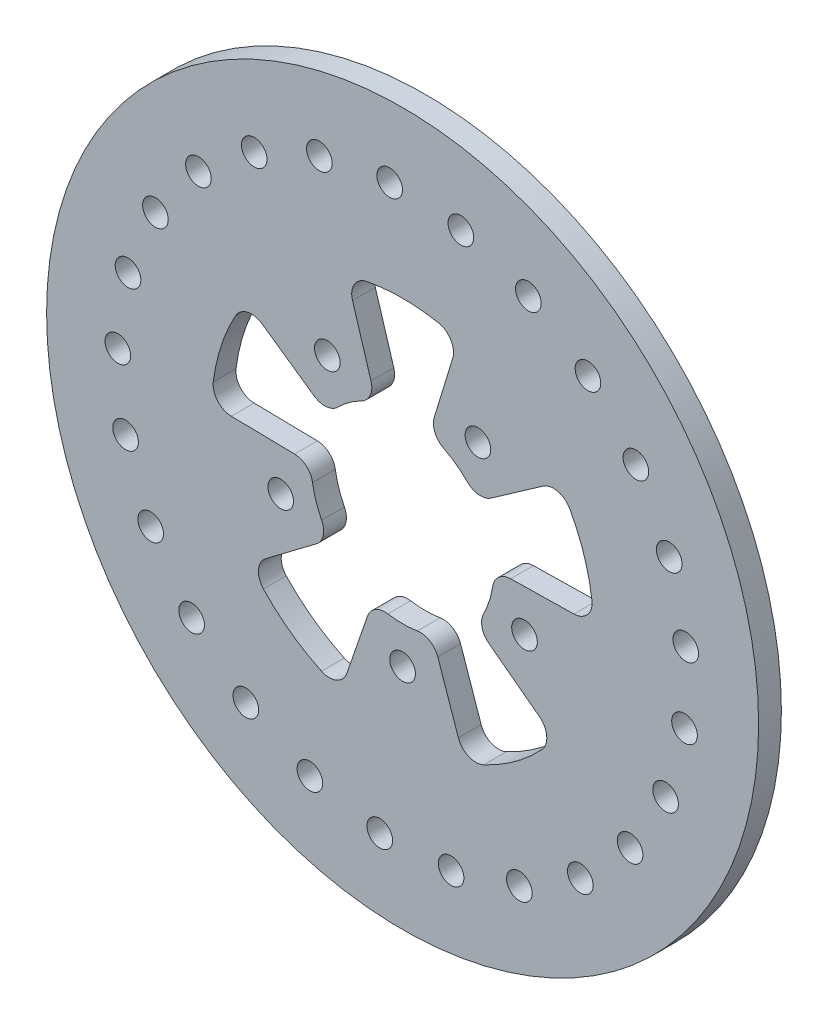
ISO-10303-21;
HEADER;
FILE_DESCRIPTION(('STEP AP214'),'2;1');
FILE_NAME('part.step','',(''),(''),'','','');
FILE_SCHEMA(('AUTOMOTIVE_DESIGN { 1 0 10303 214 1 1 1 1 }'));
ENDSEC;
DATA;
#1=APPLICATION_CONTEXT('core data for automotive mechanical design processes');
#2=APPLICATION_PROTOCOL_DEFINITION('international standard','automotive_design',2000,#1);
#3=PRODUCT_CONTEXT('',#1,'mechanical');
#4=PRODUCT('Part','Part','',(#3));
#5=PRODUCT_RELATED_PRODUCT_CATEGORY('part','',(#4));
#6=PRODUCT_DEFINITION_FORMATION('','',#4);
#7=PRODUCT_DEFINITION_CONTEXT('part definition',#1,'design');
#8=PRODUCT_DEFINITION('design','',#6,#7);
#9=PRODUCT_DEFINITION_SHAPE('','',#8);
#10=(LENGTH_UNIT() NAMED_UNIT(*) SI_UNIT(.MILLI.,.METRE.));
#11=(NAMED_UNIT(*) PLANE_ANGLE_UNIT() SI_UNIT($,.RADIAN.));
#12=(NAMED_UNIT(*) SI_UNIT($,.STERADIAN.) SOLID_ANGLE_UNIT());
#13=UNCERTAINTY_MEASURE_WITH_UNIT(LENGTH_MEASURE(1.E-05),#10,'distance_accuracy_value','');
#14=(GEOMETRIC_REPRESENTATION_CONTEXT(3) GLOBAL_UNCERTAINTY_ASSIGNED_CONTEXT((#13)) GLOBAL_UNIT_ASSIGNED_CONTEXT((#10,
#11,#12)) REPRESENTATION_CONTEXT('',''));
#15=CARTESIAN_POINT('',(0.,0.,0.));
#16=DIRECTION('',(0.,0.,1.));
#17=DIRECTION('',(1.,0.,0.));
#18=AXIS2_PLACEMENT_3D('',#15,#16,#17);
#19=CARTESIAN_POINT('',(0.,0.,4.));
#20=DIRECTION('',(0.,0.,1.));
#21=DIRECTION('',(1.,0.,0.));
#22=AXIS2_PLACEMENT_3D('',#19,#20,#21);
#23=PLANE('',#22);
#24=CARTESIAN_POINT('',(-96.4095434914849,26.5556114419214,4.));
#25=DIRECTION('',(0.,0.,1.));
#26=DIRECTION('',(1.,0.,0.));
#27=AXIS2_PLACEMENT_3D('',#24,#25,#26);
#28=CIRCLE('',#27,4.5);
#29=CARTESIAN_POINT('',(-91.9095434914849,26.5556114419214,4.));
#30=VERTEX_POINT('',#29);
#31=EDGE_CURVE('E951',#30,#30,#28,.T.);
#32=ORIENTED_EDGE('',*,*,#31,.F.);
#33=EDGE_LOOP('',(#32));
#34=FACE_BOUND('',#33,.T.);
#35=CARTESIAN_POINT('',(-86.7765484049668,49.6973957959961,4.));
#36=DIRECTION('',(0.,0.,1.));
#37=DIRECTION('',(1.,0.,0.));
#38=AXIS2_PLACEMENT_3D('',#35,#36,#37);
#39=CIRCLE('',#38,4.5);
#40=CARTESIAN_POINT('',(-82.2765484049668,49.6973957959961,4.));
#41=VERTEX_POINT('',#40);
#42=EDGE_CURVE('E945',#41,#41,#39,.T.);
#43=ORIENTED_EDGE('',*,*,#42,.F.);
#44=EDGE_LOOP('',(#43));
#45=FACE_BOUND('',#44,.T.);
#46=CARTESIAN_POINT('',(-71.6910638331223,69.716509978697,4.));
#47=DIRECTION('',(0.,0.,1.));
#48=DIRECTION('',(1.,0.,0.));
#49=AXIS2_PLACEMENT_3D('',#46,#47,#48);
#50=CIRCLE('',#49,4.5);
#51=CARTESIAN_POINT('',(-67.1910638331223,69.716509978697,4.));
#52=VERTEX_POINT('',#51);
#53=EDGE_CURVE('E939',#52,#52,#50,.T.);
#54=ORIENTED_EDGE('',*,*,#53,.F.);
#55=EDGE_LOOP('',(#54));
#56=FACE_BOUND('',#55,.T.);
#57=CARTESIAN_POINT('',(-52.1009662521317,85.3550794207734,4.));
#58=DIRECTION('',(0.,0.,1.));
#59=DIRECTION('',(1.,0.,0.));
#60=AXIS2_PLACEMENT_3D('',#57,#58,#59);
#61=CIRCLE('',#60,4.5);
#62=CARTESIAN_POINT('',(-47.6009662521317,85.3550794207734,4.));
#63=VERTEX_POINT('',#62);
#64=EDGE_CURVE('E933',#63,#63,#61,.T.);
#65=ORIENTED_EDGE('',*,*,#64,.F.);
#66=EDGE_LOOP('',(#65));
#67=FACE_BOUND('',#66,.T.);
#68=CARTESIAN_POINT('',(-29.2371735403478,95.6304752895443,4.));
#69=DIRECTION('',(0.,0.,1.));
#70=DIRECTION('',(1.,0.,0.));
#71=AXIS2_PLACEMENT_3D('',#68,#69,#70);
#72=CIRCLE('',#71,4.5);
#73=CARTESIAN_POINT('',(-24.7371735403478,95.6304752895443,4.));
#74=VERTEX_POINT('',#73);
#75=EDGE_CURVE('E927',#74,#74,#72,.T.);
#76=ORIENTED_EDGE('',*,*,#75,.F.);
#77=EDGE_LOOP('',(#76));
#78=FACE_BOUND('',#77,.T.);
#79=CARTESIAN_POINT('',(-4.53630188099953,99.8970566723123,4.));
#80=DIRECTION('',(0.,0.,1.));
#81=DIRECTION('',(1.,0.,0.));
#82=AXIS2_PLACEMENT_3D('',#79,#80,#81);
#83=CIRCLE('',#82,4.5);
#84=CARTESIAN_POINT('',(-0.0363018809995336,99.8970566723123,4.));
#85=VERTEX_POINT('',#84);
#86=EDGE_CURVE('E921',#85,#85,#83,.T.);
#87=ORIENTED_EDGE('',*,*,#86,.F.);
#88=EDGE_LOOP('',(#87));
#89=FACE_BOUND('',#88,.T.);
#90=CARTESIAN_POINT('',(20.4496021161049,97.8867385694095,4.));
#91=DIRECTION('',(0.,0.,1.));
#92=DIRECTION('',(1.,0.,0.));
#93=AXIS2_PLACEMENT_3D('',#90,#91,#92);
#94=CIRCLE('',#93,4.5);
#95=CARTESIAN_POINT('',(24.9496021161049,97.8867385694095,4.));
#96=VERTEX_POINT('',#95);
#97=EDGE_CURVE('E915',#96,#96,#94,.T.);
#98=ORIENTED_EDGE('',*,*,#97,.F.);
#99=EDGE_LOOP('',(#98));
#100=FACE_BOUND('',#99,.T.);
#101=CARTESIAN_POINT('',(44.1505822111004,89.7258366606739,4.));
#102=DIRECTION('',(0.,0.,1.));
#103=DIRECTION('',(1.,0.,0.));
#104=AXIS2_PLACEMENT_3D('',#101,#102,#103);
#105=CIRCLE('',#104,4.5);
#106=CARTESIAN_POINT('',(48.6505822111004,89.7258366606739,4.));
#107=VERTEX_POINT('',#106);
#108=EDGE_CURVE('E909',#107,#107,#105,.T.);
#109=ORIENTED_EDGE('',*,*,#108,.F.);
#110=EDGE_LOOP('',(#109));
#111=FACE_BOUND('',#110,.T.);
#112=CARTESIAN_POINT('',(65.0774186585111,75.9271304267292,4.));
#113=DIRECTION('',(0.,0.,1.));
#114=DIRECTION('',(1.,0.,0.));
#115=AXIS2_PLACEMENT_3D('',#112,#113,#114);
#116=CIRCLE('',#115,4.5);
#117=CARTESIAN_POINT('',(69.5774186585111,75.9271304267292,4.));
#118=VERTEX_POINT('',#117);
#119=EDGE_CURVE('E903',#118,#118,#116,.T.);
#120=ORIENTED_EDGE('',*,*,#119,.F.);
#121=EDGE_LOOP('',(#120));
#122=FACE_BOUND('',#121,.T.);
#123=CARTESIAN_POINT('',(81.9152013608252,57.3576433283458,4.));
#124=DIRECTION('',(0.,0.,1.));
#125=DIRECTION('',(1.,0.,0.));
#126=AXIS2_PLACEMENT_3D('',#123,#124,#125);
#127=CIRCLE('',#126,4.5);
#128=CARTESIAN_POINT('',(86.4152013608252,57.3576433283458,4.));
#129=VERTEX_POINT('',#128);
#130=EDGE_CURVE('E897',#129,#129,#127,.T.);
#131=ORIENTED_EDGE('',*,*,#130,.F.);
#132=EDGE_LOOP('',(#131));
#133=FACE_BOUND('',#132,.T.);
#134=CARTESIAN_POINT('',(93.6059505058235,35.1841645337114,4.));
#135=DIRECTION('',(0.,0.,1.));
#136=DIRECTION('',(1.,0.,0.));
#137=AXIS2_PLACEMENT_3D('',#134,#135,#136);
#138=CIRCLE('',#137,4.5);
#139=CARTESIAN_POINT('',(98.1059505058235,35.1841645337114,4.));
#140=VERTEX_POINT('',#139);
#141=EDGE_CURVE('E891',#140,#140,#138,.T.);
#142=ORIENTED_EDGE('',*,*,#141,.F.);
#143=EDGE_LOOP('',(#142));
#144=FACE_BOUND('',#143,.T.);
#145=CARTESIAN_POINT('',(99.4150933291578,10.7999352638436,4.));
#146=DIRECTION('',(0.,0.,1.));
#147=DIRECTION('',(1.,0.,0.));
#148=AXIS2_PLACEMENT_3D('',#145,#146,#147);
#149=CIRCLE('',#148,4.5);
#150=CARTESIAN_POINT('',(103.915093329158,10.7999352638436,4.));
#151=VERTEX_POINT('',#150);
#152=EDGE_CURVE('E885',#151,#151,#149,.T.);
#153=ORIENTED_EDGE('',*,*,#152,.F.);
#154=EDGE_LOOP('',(#153));
#155=FACE_BOUND('',#154,.T.);
#156=CARTESIAN_POINT('',(98.9776200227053,-14.2628936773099,4.));
#157=DIRECTION('',(0.,0.,1.));
#158=DIRECTION('',(1.,0.,0.));
#159=AXIS2_PLACEMENT_3D('',#156,#157,#158);
#160=CIRCLE('',#159,4.5);
#161=CARTESIAN_POINT('',(103.477620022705,-14.2628936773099,4.));
#162=VERTEX_POINT('',#161);
#163=EDGE_CURVE('E879',#162,#162,#160,.T.);
#164=ORIENTED_EDGE('',*,*,#163,.F.);
#165=EDGE_LOOP('',(#164));
#166=FACE_BOUND('',#165,.T.);
#167=CARTESIAN_POINT('',(92.3210186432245,-38.4295325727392,4.));
#168=DIRECTION('',(0.,0.,1.));
#169=DIRECTION('',(1.,0.,0.));
#170=AXIS2_PLACEMENT_3D('',#167,#168,#169);
#171=CIRCLE('',#170,4.5);
#172=CARTESIAN_POINT('',(96.8210186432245,-38.4295325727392,4.));
#173=VERTEX_POINT('',#172);
#174=EDGE_CURVE('E873',#173,#173,#171,.T.);
#175=ORIENTED_EDGE('',*,*,#174,.F.);
#176=EDGE_LOOP('',(#175));
#177=FACE_BOUND('',#176,.T.);
#178=CARTESIAN_POINT('',(79.8635479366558,-60.1815026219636,4.));
#179=DIRECTION('',(0.,0.,1.));
#180=DIRECTION('',(1.,0.,0.));
#181=AXIS2_PLACEMENT_3D('',#178,#179,#180);
#182=CIRCLE('',#181,4.5);
#183=CARTESIAN_POINT('',(84.3635479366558,-60.1815026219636,4.));
#184=VERTEX_POINT('',#183);
#185=EDGE_CURVE('E867',#184,#184,#182,.T.);
#186=ORIENTED_EDGE('',*,*,#185,.F.);
#187=EDGE_LOOP('',(#186));
#188=FACE_BOUND('',#187,.T.);
#189=CARTESIAN_POINT('',(62.3879566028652,-78.1520475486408,4.));
#190=DIRECTION('',(0.,0.,1.));
#191=DIRECTION('',(1.,0.,0.));
#192=AXIS2_PLACEMENT_3D('',#189,#190,#191);
#193=CIRCLE('',#192,4.5);
#194=CARTESIAN_POINT('',(66.8879566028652,-78.1520475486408,4.));
#195=VERTEX_POINT('',#194);
#196=EDGE_CURVE('E860',#195,#195,#193,.T.);
#197=ORIENTED_EDGE('',*,*,#196,.F.);
#198=EDGE_LOOP('',(#197));
#199=FACE_BOUND('',#198,.T.);
#200=CARTESIAN_POINT('',(40.9923003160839,-91.2120119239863,4.));
#201=DIRECTION('',(0.,0.,1.));
#202=DIRECTION('',(1.,0.,0.));
#203=AXIS2_PLACEMENT_3D('',#200,#201,#202);
#204=CIRCLE('',#203,4.5);
#205=CARTESIAN_POINT('',(45.4923003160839,-91.2120119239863,4.));
#206=VERTEX_POINT('',#205);
#207=EDGE_CURVE('E998',#206,#206,#204,.T.);
#208=ORIENTED_EDGE('',*,*,#207,.F.);
#209=EDGE_LOOP('',(#208));
#210=FACE_BOUND('',#209,.T.);
#211=CARTESIAN_POINT('',(17.0209468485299,-98.5407901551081,4.));
#212=DIRECTION('',(0.,0.,1.));
#213=DIRECTION('',(1.,0.,0.));
#214=AXIS2_PLACEMENT_3D('',#211,#212,#213);
#215=CIRCLE('',#214,4.5);
#216=CARTESIAN_POINT('',(21.5209468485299,-98.5407901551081,4.));
#217=VERTEX_POINT('',#216);
#218=EDGE_CURVE('E992',#217,#217,#215,.T.);
#219=ORIENTED_EDGE('',*,*,#218,.F.);
#220=EDGE_LOOP('',(#219));
#221=FACE_BOUND('',#220,.T.);
#222=CARTESIAN_POINT('',(-8.01989550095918,-99.6778881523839,4.));
#223=DIRECTION('',(0.,0.,1.));
#224=DIRECTION('',(1.,0.,0.));
#225=AXIS2_PLACEMENT_3D('',#222,#223,#224);
#226=CIRCLE('',#225,4.5);
#227=CARTESIAN_POINT('',(-3.51989550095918,-99.6778881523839,4.));
#228=VERTEX_POINT('',#227);
#229=EDGE_CURVE('E986',#228,#228,#226,.T.);
#230=ORIENTED_EDGE('',*,*,#229,.F.);
#231=EDGE_LOOP('',(#230));
#232=FACE_BOUND('',#231,.T.);
#233=CARTESIAN_POINT('',(-32.556818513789,-94.551857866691,4.));
#234=DIRECTION('',(0.,0.,1.));
#235=DIRECTION('',(1.,0.,0.));
#236=AXIS2_PLACEMENT_3D('',#233,#234,#235);
#237=CIRCLE('',#236,4.5);
#238=CARTESIAN_POINT('',(-28.056818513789,-94.551857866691,4.));
#239=VERTEX_POINT('',#238);
#240=EDGE_CURVE('E980',#239,#239,#237,.T.);
#241=ORIENTED_EDGE('',*,*,#240,.F.);
#242=EDGE_LOOP('',(#241));
#243=FACE_BOUND('',#242,.T.);
#244=CARTESIAN_POINT('',(-55.048077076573,-83.4847866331,4.));
#245=DIRECTION('',(0.,0.,1.));
#246=DIRECTION('',(1.,0.,0.));
#247=AXIS2_PLACEMENT_3D('',#244,#245,#246);
#248=CIRCLE('',#247,4.5);
#249=CARTESIAN_POINT('',(-50.548077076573,-83.4847866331,4.));
#250=VERTEX_POINT('',#249);
#251=EDGE_CURVE('E974',#250,#250,#248,.T.);
#252=ORIENTED_EDGE('',*,*,#251,.F.);
#253=EDGE_LOOP('',(#252));
#254=FACE_BOUND('',#253,.T.);
#255=CARTESIAN_POINT('',(-74.0804626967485,-67.1720592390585,4.));
#256=DIRECTION('',(0.,0.,1.));
#257=DIRECTION('',(1.,0.,0.));
#258=AXIS2_PLACEMENT_3D('',#255,#256,#257);
#259=CIRCLE('',#258,4.5);
#260=CARTESIAN_POINT('',(-69.5804626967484,-67.1720592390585,4.));
#261=VERTEX_POINT('',#260);
#262=EDGE_CURVE('E968',#261,#261,#259,.T.);
#263=ORIENTED_EDGE('',*,*,#262,.F.);
#264=EDGE_LOOP('',(#263));
#265=FACE_BOUND('',#264,.T.);
#266=CARTESIAN_POINT('',(-88.4581005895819,-46.6386643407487,4.));
#267=DIRECTION('',(0.,0.,1.));
#268=DIRECTION('',(1.,0.,0.));
#269=AXIS2_PLACEMENT_3D('',#266,#267,#268);
#270=CIRCLE('',#269,4.5);
#271=CARTESIAN_POINT('',(-83.9581005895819,-46.6386643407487,4.));
#272=VERTEX_POINT('',#271);
#273=EDGE_CURVE('E962',#272,#272,#270,.T.);
#274=ORIENTED_EDGE('',*,*,#273,.F.);
#275=EDGE_LOOP('',(#274));
#276=FACE_BOUND('',#275,.T.);
#277=CARTESIAN_POINT('',(-97.2775908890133,-23.1747906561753,4.));
#278=DIRECTION('',(0.,0.,1.));
#279=DIRECTION('',(1.,0.,0.));
#280=AXIS2_PLACEMENT_3D('',#277,#278,#279);
#281=CIRCLE('',#280,4.5);
#282=CARTESIAN_POINT('',(-92.7775908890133,-23.1747906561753,4.));
#283=VERTEX_POINT('',#282);
#284=EDGE_CURVE('E956',#283,#283,#281,.T.);
#285=ORIENTED_EDGE('',*,*,#284,.F.);
#286=EDGE_LOOP('',(#285));
#287=FACE_BOUND('',#286,.T.);
#288=CARTESIAN_POINT('',(-99.9847725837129,1.7452403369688,4.));
#289=DIRECTION('',(0.,0.,1.));
#290=DIRECTION('',(1.,0.,0.));
#291=AXIS2_PLACEMENT_3D('',#288,#289,#290);
#292=CIRCLE('',#291,4.5);
#293=CARTESIAN_POINT('',(-95.4847725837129,1.7452403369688,4.));
#294=VERTEX_POINT('',#293);
#295=EDGE_CURVE('E854',#294,#294,#292,.T.);
#296=ORIENTED_EDGE('',*,*,#295,.F.);
#297=EDGE_LOOP('',(#296));
#298=FACE_BOUND('',#297,.T.);
#299=CARTESIAN_POINT('',(-42.797543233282,-13.9057647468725,4.));
#300=DIRECTION('',(0.,0.,1.));
#301=DIRECTION('',(0.309016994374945,0.951056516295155,0.));
#302=AXIS2_PLACEMENT_3D('',#299,#300,#301);
#303=CIRCLE('',#302,4.50000000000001);
#304=CARTESIAN_POINT('',(-41.4069667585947,-9.62601042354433,4.));
#305=VERTEX_POINT('',#304);
#306=EDGE_CURVE('E847',#305,#305,#303,.T.);
#307=ORIENTED_EDGE('',*,*,#306,.F.);
#308=EDGE_LOOP('',(#307));
#309=FACE_BOUND('',#308,.T.);
#310=CARTESIAN_POINT('',(0.,-45.,4.));
#311=DIRECTION('',(0.,0.,1.));
#312=DIRECTION('',(-0.809016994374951,0.587785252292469,0.));
#313=AXIS2_PLACEMENT_3D('',#310,#311,#312);
#314=CIRCLE('',#313,4.50000000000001);
#315=CARTESIAN_POINT('',(-3.64057647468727,-42.3549663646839,4.));
#316=VERTEX_POINT('',#315);
#317=EDGE_CURVE('E841',#316,#316,#314,.T.);
#318=ORIENTED_EDGE('',*,*,#317,.F.);
#319=EDGE_LOOP('',(#318));
#320=FACE_BOUND('',#319,.T.);
#321=CARTESIAN_POINT('',(42.797543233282,-13.9057647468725,4.));
#322=DIRECTION('',(0.,0.,1.));
#323=DIRECTION('',(-0.809016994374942,-0.58778525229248,0.));
#324=AXIS2_PLACEMENT_3D('',#321,#322,#323);
#325=CIRCLE('',#324,4.50000000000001);
#326=CARTESIAN_POINT('',(39.1569667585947,-16.5507983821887,4.));
#327=VERTEX_POINT('',#326);
#328=EDGE_CURVE('E833',#327,#327,#325,.T.);
#329=ORIENTED_EDGE('',*,*,#328,.F.);
#330=EDGE_LOOP('',(#329));
#331=FACE_BOUND('',#330,.T.);
#332=CARTESIAN_POINT('',(26.4503363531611,36.4057647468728,4.));
#333=DIRECTION('',(0.,0.,1.));
#334=DIRECTION('',(0.309016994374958,-0.95105651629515,0.));
#335=AXIS2_PLACEMENT_3D('',#332,#333,#334);
#336=CIRCLE('',#335,4.50000000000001);
#337=CARTESIAN_POINT('',(27.8409128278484,32.1260104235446,4.));
#338=VERTEX_POINT('',#337);
#339=EDGE_CURVE('E834',#338,#338,#336,.T.);
#340=ORIENTED_EDGE('',*,*,#339,.F.);
#341=EDGE_LOOP('',(#340));
#342=FACE_BOUND('',#341,.T.);
#343=CARTESIAN_POINT('',(-26.4503363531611,36.4057647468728,4.));
#344=DIRECTION('',(0.,0.,1.));
#345=DIRECTION('',(1.,0.,0.));
#346=AXIS2_PLACEMENT_3D('',#343,#344,#345);
#347=CIRCLE('',#346,4.50000000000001);
#348=CARTESIAN_POINT('',(-21.9503363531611,36.4057647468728,4.));
#349=VERTEX_POINT('',#348);
#350=EDGE_CURVE('E464',#349,#349,#347,.T.);
#351=ORIENTED_EDGE('',*,*,#350,.F.);
#352=EDGE_LOOP('',(#351));
#353=FACE_BOUND('',#352,.T.);
#354=CARTESIAN_POINT('',(0.,0.,4.));
#355=DIRECTION('',(0.,0.,1.));
#356=DIRECTION('',(1.,0.,0.));
#357=AXIS2_PLACEMENT_3D('',#354,#355,#356);
#358=CIRCLE('',#357,125.);
#359=CARTESIAN_POINT('',(125.,0.,4.));
#360=VERTEX_POINT('',#359);
#361=EDGE_CURVE('E318',#360,#360,#358,.T.);
#362=ORIENTED_EDGE('',*,*,#361,.T.);
#363=EDGE_LOOP('',(#362));
#364=FACE_BOUND('',#363,.T.);
#365=DIRECTION('',(0.999847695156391,0.0174524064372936,0.));
#366=VECTOR('',#365,1.);
#367=CARTESIAN_POINT('',(31.9951262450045,0.558477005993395,4.));
#368=LINE('',#367,#366);
#369=CARTESIAN_POINT('',(37.9415523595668,0.662272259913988,4.));
#370=VERTEX_POINT('',#369);
#371=CARTESIAN_POINT('',(60.1406518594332,1.04975898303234,4.));
#372=VERTEX_POINT('',#371);
#373=EDGE_CURVE('E315',#370,#372,#368,.T.);
#374=ORIENTED_EDGE('',*,*,#373,.F.);
#375=CARTESIAN_POINT('',(38.0549930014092,-5.83673775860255,4.));
#376=DIRECTION('',(0.,0.,1.));
#377=DIRECTION('',(1.,0.,0.));
#378=AXIS2_PLACEMENT_3D('',#375,#376,#377);
#379=CIRCLE('',#378,6.5);
#380=CARTESIAN_POINT('',(31.6301240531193,-4.85131450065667,4.));
#381=VERTEX_POINT('',#380);
#382=EDGE_CURVE('E523',#370,#381,#379,.T.);
#383=ORIENTED_EDGE('',*,*,#382,.T.);
#384=CARTESIAN_POINT('',(0.,0.,4.));
#385=DIRECTION('',(0.,0.,1.));
#386=DIRECTION('',(1.,0.,0.));
#387=AXIS2_PLACEMENT_3D('',#384,#385,#386);
#388=CIRCLE('',#387,32.);
#389=CARTESIAN_POINT('',(28.4408390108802,-14.6669245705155,4.));
#390=VERTEX_POINT('',#389);
#391=EDGE_CURVE('E763',#390,#381,#388,.T.);
#392=ORIENTED_EDGE('',*,*,#391,.F.);
#393=CARTESIAN_POINT('',(34.2178844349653,-17.6461436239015,4.));
#394=DIRECTION('',(0.,0.,1.));
#395=DIRECTION('',(1.,0.,0.));
#396=AXIS2_PLACEMENT_3D('',#393,#394,#395);
#397=CIRCLE('',#396,6.5);
#398=CARTESIAN_POINT('',(30.306086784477,-22.837274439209,4.));
#399=VERTEX_POINT('',#398);
#400=EDGE_CURVE('E521',#390,#399,#397,.T.);
#401=ORIENTED_EDGE('',*,*,#400,.T.);
#402=DIRECTION('',(0.798635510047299,-0.60181502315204,0.));
#403=VECTOR('',#402,1.);
#404=CARTESIAN_POINT('',(25.5563363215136,-19.2580807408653,4.));
#405=LINE('',#404,#403);
#406=CARTESIAN_POINT('',(48.0377765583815,-36.1990610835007,4.));
#407=VERTEX_POINT('',#406);
#408=EDGE_CURVE('E430',#399,#407,#405,.T.);
#409=ORIENTED_EDGE('',*,*,#408,.T.);
#410=CARTESIAN_POINT('',(44.1259789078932,-41.3901918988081,4.));
#411=DIRECTION('',(0.,0.,1.));
#412=DIRECTION('',(1.,0.,0.));
#413=AXIS2_PLACEMENT_3D('',#410,#411,#412);
#414=CIRCLE('',#413,6.5);
#415=CARTESIAN_POINT('',(48.8667865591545,-45.8370720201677,4.));
#416=VERTEX_POINT('',#415);
#417=EDGE_CURVE('E360',#407,#416,#414,.F.);
#418=ORIENTED_EDGE('',*,*,#417,.T.);
#419=CARTESIAN_POINT('',(0.,0.,4.));
#420=DIRECTION('',(0.,0.,1.));
#421=DIRECTION('',(-0.809016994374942,-0.58778525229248,0.));
#422=AXIS2_PLACEMENT_3D('',#419,#420,#421);
#423=CIRCLE('',#422,67.);
#424=CARTESIAN_POINT('',(28.4929785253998,-60.639510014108,4.));
#425=VERTEX_POINT('',#424);
#426=EDGE_CURVE('E433',#425,#416,#423,.T.);
#427=ORIENTED_EDGE('',*,*,#426,.F.);
#428=CARTESIAN_POINT('',(25.7287343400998,-54.7565724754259,4.));
#429=DIRECTION('',(0.,0.,1.));
#430=DIRECTION('',(1.,0.,0.));
#431=AXIS2_PLACEMENT_3D('',#428,#429,#430);
#432=CIRCLE('',#431,6.5);
#433=CARTESIAN_POINT('',(19.5828635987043,-56.8727654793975,4.));
#434=VERTEX_POINT('',#433);
#435=EDGE_CURVE('E330',#425,#434,#432,.F.);
#436=ORIENTED_EDGE('',*,*,#435,.T.);
#437=DIRECTION('',(0.325568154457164,-0.945518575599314,0.));
#438=VECTOR('',#437,1.);
#439=CARTESIAN_POINT('',(10.4181809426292,-30.2565944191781,4.));
#440=LINE('',#439,#438);
#441=CARTESIAN_POINT('',(12.3544428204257,-35.8799072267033,4.));
#442=VERTEX_POINT('',#441);
#443=EDGE_CURVE('E436',#442,#434,#440,.T.);
#444=ORIENTED_EDGE('',*,*,#443,.F.);
#445=CARTESIAN_POINT('',(6.20857207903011,-37.9961002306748,4.));
#446=DIRECTION('',(0.,0.,1.));
#447=DIRECTION('',(1.,0.,0.));
#448=AXIS2_PLACEMENT_3D('',#445,#446,#447);
#449=CIRCLE('',#448,6.5);
#450=CARTESIAN_POINT('',(5.16037159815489,-31.5811742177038,4.));
#451=VERTEX_POINT('',#450);
#452=EDGE_CURVE('E519',#442,#451,#449,.T.);
#453=ORIENTED_EDGE('',*,*,#452,.T.);
#454=CARTESIAN_POINT('',(-5.16037159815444,-31.5811742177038,4.));
#455=VERTEX_POINT('',#454);
#456=EDGE_CURVE('E779',#455,#451,#388,.T.);
#457=ORIENTED_EDGE('',*,*,#456,.F.);
#458=CARTESIAN_POINT('',(-6.20857207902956,-37.9961002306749,4.));
#459=DIRECTION('',(0.,0.,1.));
#460=DIRECTION('',(1.,0.,0.));
#461=AXIS2_PLACEMENT_3D('',#458,#459,#460);
#462=CIRCLE('',#461,6.5);
#463=CARTESIAN_POINT('',(-12.3544428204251,-35.8799072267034,4.));
#464=VERTEX_POINT('',#463);
#465=EDGE_CURVE('E517',#455,#464,#462,.T.);
#466=ORIENTED_EDGE('',*,*,#465,.T.);
#467=DIRECTION('',(-0.32556815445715,-0.945518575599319,0.));
#468=VECTOR('',#467,1.);
#469=CARTESIAN_POINT('',(-10.4181809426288,-30.2565944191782,4.));
#470=LINE('',#469,#468);
#471=CARTESIAN_POINT('',(-19.5828635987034,-56.8727654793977,4.));
#472=VERTEX_POINT('',#471);
#473=EDGE_CURVE('E414',#464,#472,#470,.T.);
#474=ORIENTED_EDGE('',*,*,#473,.T.);
#475=CARTESIAN_POINT('',(-25.728734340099,-54.7565724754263,4.));
#476=DIRECTION('',(0.,0.,1.));
#477=DIRECTION('',(1.,0.,0.));
#478=AXIS2_PLACEMENT_3D('',#475,#476,#477);
#479=CIRCLE('',#478,6.5);
#480=CARTESIAN_POINT('',(-28.4929785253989,-60.6395100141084,4.));
#481=VERTEX_POINT('',#480);
#482=EDGE_CURVE('E364',#472,#481,#479,.F.);
#483=ORIENTED_EDGE('',*,*,#482,.T.);
#484=CARTESIAN_POINT('',(0.,0.,4.));
#485=DIRECTION('',(0.,0.,1.));
#486=DIRECTION('',(-0.809016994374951,0.587785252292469,0.));
#487=AXIS2_PLACEMENT_3D('',#484,#485,#486);
#488=CIRCLE('',#487,67.);
#489=CARTESIAN_POINT('',(-48.8667865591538,-45.8370720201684,4.));
#490=VERTEX_POINT('',#489);
#491=EDGE_CURVE('E404',#490,#481,#488,.T.);
#492=ORIENTED_EDGE('',*,*,#491,.F.);
#493=CARTESIAN_POINT('',(-44.1259789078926,-41.3901918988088,4.));
#494=DIRECTION('',(0.,0.,1.));
#495=DIRECTION('',(1.,0.,0.));
#496=AXIS2_PLACEMENT_3D('',#493,#494,#495);
#497=CIRCLE('',#496,6.5);
#498=CARTESIAN_POINT('',(-48.037776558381,-36.1990610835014,4.));
#499=VERTEX_POINT('',#498);
#500=EDGE_CURVE('E348',#490,#499,#497,.F.);
#501=ORIENTED_EDGE('',*,*,#500,.T.);
#502=DIRECTION('',(-0.79863551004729,-0.601815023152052,0.));
#503=VECTOR('',#502,1.);
#504=CARTESIAN_POINT('',(-25.5563363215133,-19.2580807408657,4.));
#505=LINE('',#504,#503);
#506=CARTESIAN_POINT('',(-30.3060867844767,-22.8372744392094,4.));
#507=VERTEX_POINT('',#506);
#508=EDGE_CURVE('E413',#507,#499,#505,.T.);
#509=ORIENTED_EDGE('',*,*,#508,.F.);
#510=CARTESIAN_POINT('',(-34.217884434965,-17.646143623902,4.));
#511=DIRECTION('',(0.,0.,1.));
#512=DIRECTION('',(1.,0.,0.));
#513=AXIS2_PLACEMENT_3D('',#510,#511,#512);
#514=CIRCLE('',#513,6.5);
#515=CARTESIAN_POINT('',(-28.44083901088,-14.666924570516,4.));
#516=VERTEX_POINT('',#515);
#517=EDGE_CURVE('E515',#507,#516,#514,.T.);
#518=ORIENTED_EDGE('',*,*,#517,.T.);
#519=CARTESIAN_POINT('',(-31.6301240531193,-4.85131450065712,4.));
#520=VERTEX_POINT('',#519);
#521=EDGE_CURVE('E493',#520,#516,#388,.T.);
#522=ORIENTED_EDGE('',*,*,#521,.F.);
#523=CARTESIAN_POINT('',(-38.0549930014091,-5.8367377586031,4.));
#524=DIRECTION('',(0.,0.,1.));
#525=DIRECTION('',(1.,0.,0.));
#526=AXIS2_PLACEMENT_3D('',#523,#524,#525);
#527=CIRCLE('',#526,6.5);
#528=CARTESIAN_POINT('',(-37.9415523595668,0.662272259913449,4.));
#529=VERTEX_POINT('',#528);
#530=EDGE_CURVE('E513',#520,#529,#527,.T.);
#531=ORIENTED_EDGE('',*,*,#530,.T.);
#532=DIRECTION('',(-0.999847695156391,0.0174524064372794,0.));
#533=VECTOR('',#532,1.);
#534=CARTESIAN_POINT('',(-31.9951262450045,0.55847700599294,4.));
#535=LINE('',#534,#533);
#536=CARTESIAN_POINT('',(-60.1406518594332,1.04975898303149,4.));
#537=VERTEX_POINT('',#536);
#538=EDGE_CURVE('E373',#529,#537,#535,.T.);
#539=ORIENTED_EDGE('',*,*,#538,.T.);
#540=CARTESIAN_POINT('',(-60.0272112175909,7.54876900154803,4.));
#541=DIRECTION('',(0.,0.,1.));
#542=DIRECTION('',(1.,0.,0.));
#543=AXIS2_PLACEMENT_3D('',#540,#541,#542);
#544=CIRCLE('',#543,6.5);
#545=CARTESIAN_POINT('',(-66.4764157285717,8.35979377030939,4.));
#546=VERTEX_POINT('',#545);
#547=EDGE_CURVE('E58',#537,#546,#544,.F.);
#548=ORIENTED_EDGE('',*,*,#547,.T.);
#549=CARTESIAN_POINT('',(0.,0.,4.));
#550=DIRECTION('',(0.,0.,1.));
#551=DIRECTION('',(0.309016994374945,0.951056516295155,0.));
#552=AXIS2_PLACEMENT_3D('',#549,#550,#551);
#553=CIRCLE('',#552,67.);
#554=CARTESIAN_POINT('',(-58.6943135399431,32.3106415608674,4.));
#555=VERTEX_POINT('',#554);
#556=EDGE_CURVE('E371',#555,#546,#553,.T.);
#557=ORIENTED_EDGE('',*,*,#556,.F.);
#558=CARTESIAN_POINT('',(-53.0000890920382,29.1760270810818,4.));
#559=DIRECTION('',(0.,0.,1.));
#560=DIRECTION('',(1.,0.,0.));
#561=AXIS2_PLACEMENT_3D('',#558,#559,#560);
#562=CIRCLE('',#561,6.5);
#563=CARTESIAN_POINT('',(-49.2718422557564,34.5005153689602,4.));
#564=VERTEX_POINT('',#563);
#565=EDGE_CURVE('E344',#555,#564,#562,.F.);
#566=ORIENTED_EDGE('',*,*,#565,.T.);
#567=DIRECTION('',(-0.819152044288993,0.573576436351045,0.));
#568=VECTOR('',#567,1.);
#569=CARTESIAN_POINT('',(-26.2128654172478,18.3544459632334,4.));
#570=LINE('',#569,#568);
#571=CARTESIAN_POINT('',(-31.0846345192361,21.7656954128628,4.));
#572=VERTEX_POINT('',#571);
#573=EDGE_CURVE('E386',#572,#564,#570,.T.);
#574=ORIENTED_EDGE('',*,*,#573,.F.);
#575=CARTESIAN_POINT('',(-27.3563876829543,27.0901837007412,4.));
#576=DIRECTION('',(0.,0.,1.));
#577=DIRECTION('',(1.,0.,0.));
#578=AXIS2_PLACEMENT_3D('',#575,#576,#577);
#579=CIRCLE('',#578,6.5);
#580=CARTESIAN_POINT('',(-22.7377767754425,22.516516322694,4.));
#581=VERTEX_POINT('',#580);
#582=EDGE_CURVE('E505',#572,#581,#579,.T.);
#583=ORIENTED_EDGE('',*,*,#582,.T.);
#584=CARTESIAN_POINT('',(-14.3881201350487,28.5828969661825,4.));
#585=VERTEX_POINT('',#584);
#586=EDGE_CURVE('E489',#585,#581,#388,.T.);
#587=ORIENTED_EDGE('',*,*,#586,.F.);
#588=CARTESIAN_POINT('',(-17.3107070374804,34.3887979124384,4.));
#589=DIRECTION('',(0.,0.,1.));
#590=DIRECTION('',(1.,0.,0.));
#591=AXIS2_PLACEMENT_3D('',#588,#589,#590);
#592=CIRCLE('',#591,6.5);
#593=CARTESIAN_POINT('',(-11.0947261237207,36.2892139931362,4.));
#594=VERTEX_POINT('',#593);
#595=EDGE_CURVE('E511',#585,#594,#592,.T.);
#596=ORIENTED_EDGE('',*,*,#595,.T.);
#597=DIRECTION('',(-0.292371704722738,0.956304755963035,0.));
#598=VECTOR('',#597,1.);
#599=CARTESIAN_POINT('',(-9.35589455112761,30.6017521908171,4.));
#600=LINE('',#599,#598);
#601=CARTESIAN_POINT('',(-17.5861033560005,57.5215522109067,4.));
#602=VERTEX_POINT('',#601);
#603=EDGE_CURVE('E476',#594,#602,#600,.T.);
#604=ORIENTED_EDGE('',*,*,#603,.T.);
#605=CARTESIAN_POINT('',(-11.3701224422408,59.4219682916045,4.));
#606=DIRECTION('',(0.,0.,1.));
#607=DIRECTION('',(1.,0.,0.));
#608=AXIS2_PLACEMENT_3D('',#605,#606,#607);
#609=CIRCLE('',#608,6.5);
#610=CARTESIAN_POINT('',(-12.5917058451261,65.8061467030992,4.));
#611=VERTEX_POINT('',#610);
#612=EDGE_CURVE('E340',#602,#611,#609,.F.);
#613=ORIENTED_EDGE('',*,*,#612,.T.);
#614=CARTESIAN_POINT('',(0.,0.,4.));
#615=DIRECTION('',(0.,0.,1.));
#616=DIRECTION('',(1.,0.,0.));
#617=AXIS2_PLACEMENT_3D('',#614,#615,#616);
#618=CIRCLE('',#617,67.);
#619=CARTESIAN_POINT('',(12.5917058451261,65.8061467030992,4.));
#620=VERTEX_POINT('',#619);
#621=EDGE_CURVE('E479',#620,#611,#618,.T.);
#622=ORIENTED_EDGE('',*,*,#621,.F.);
#623=CARTESIAN_POINT('',(11.3701224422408,59.4219682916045,4.));
#624=DIRECTION('',(0.,0.,1.));
#625=DIRECTION('',(1.,0.,0.));
#626=AXIS2_PLACEMENT_3D('',#623,#624,#625);
#627=CIRCLE('',#626,6.5);
#628=CARTESIAN_POINT('',(17.5861033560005,57.5215522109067,4.));
#629=VERTEX_POINT('',#628);
#630=EDGE_CURVE('E352',#620,#629,#627,.F.);
#631=ORIENTED_EDGE('',*,*,#630,.T.);
#632=DIRECTION('',(0.292371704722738,0.956304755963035,0.));
#633=VECTOR('',#632,1.);
#634=CARTESIAN_POINT('',(9.35589455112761,30.6017521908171,4.));
#635=LINE('',#634,#633);
#636=CARTESIAN_POINT('',(11.0947261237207,36.2892139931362,4.));
#637=VERTEX_POINT('',#636);
#638=EDGE_CURVE('E482',#637,#629,#635,.T.);
#639=ORIENTED_EDGE('',*,*,#638,.F.);
#640=CARTESIAN_POINT('',(17.3107070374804,34.3887979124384,4.));
#641=DIRECTION('',(0.,0.,1.));
#642=DIRECTION('',(1.,0.,0.));
#643=AXIS2_PLACEMENT_3D('',#640,#641,#642);
#644=CIRCLE('',#643,6.5);
#645=CARTESIAN_POINT('',(14.3881201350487,28.5828969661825,4.));
#646=VERTEX_POINT('',#645);
#647=EDGE_CURVE('E507',#637,#646,#644,.T.);
#648=ORIENTED_EDGE('',*,*,#647,.T.);
#649=CARTESIAN_POINT('',(22.7377767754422,22.5165163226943,4.));
#650=VERTEX_POINT('',#649);
#651=EDGE_CURVE('E494',#650,#646,#388,.T.);
#652=ORIENTED_EDGE('',*,*,#651,.F.);
#653=CARTESIAN_POINT('',(27.3563876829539,27.0901837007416,4.));
#654=DIRECTION('',(0.,0.,1.));
#655=DIRECTION('',(1.,0.,0.));
#656=AXIS2_PLACEMENT_3D('',#653,#654,#655);
#657=CIRCLE('',#656,6.5);
#658=CARTESIAN_POINT('',(31.0846345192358,21.7656954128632,4.));
#659=VERTEX_POINT('',#658);
#660=EDGE_CURVE('E509',#650,#659,#657,.T.);
#661=ORIENTED_EDGE('',*,*,#660,.T.);
#662=DIRECTION('',(0.819152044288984,0.573576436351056,0.));
#663=VECTOR('',#662,1.);
#664=CARTESIAN_POINT('',(26.2128654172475,18.3544459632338,4.));
#665=LINE('',#664,#663);
#666=CARTESIAN_POINT('',(49.2718422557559,34.5005153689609,4.));
#667=VERTEX_POINT('',#666);
#668=EDGE_CURVE('E448',#659,#667,#665,.T.);
#669=ORIENTED_EDGE('',*,*,#668,.T.);
#670=CARTESIAN_POINT('',(53.0000890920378,29.1760270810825,4.));
#671=DIRECTION('',(0.,0.,1.));
#672=DIRECTION('',(1.,0.,0.));
#673=AXIS2_PLACEMENT_3D('',#670,#671,#672);
#674=CIRCLE('',#673,6.5);
#675=CARTESIAN_POINT('',(58.6943135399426,32.3106415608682,4.));
#676=VERTEX_POINT('',#675);
#677=EDGE_CURVE('E356',#667,#676,#674,.F.);
#678=ORIENTED_EDGE('',*,*,#677,.T.);
#679=CARTESIAN_POINT('',(0.,0.,4.));
#680=DIRECTION('',(0.,0.,1.));
#681=DIRECTION('',(0.309016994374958,-0.95105651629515,0.));
#682=AXIS2_PLACEMENT_3D('',#679,#680,#681);
#683=CIRCLE('',#682,67.);
#684=CARTESIAN_POINT('',(66.4764157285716,8.35979377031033,4.));
#685=VERTEX_POINT('',#684);
#686=EDGE_CURVE('E451',#685,#676,#683,.T.);
#687=ORIENTED_EDGE('',*,*,#686,.F.);
#688=CARTESIAN_POINT('',(60.0272112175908,7.54876900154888,4.));
#689=DIRECTION('',(0.,0.,1.));
#690=DIRECTION('',(1.,0.,0.));
#691=AXIS2_PLACEMENT_3D('',#688,#689,#690);
#692=CIRCLE('',#691,6.5);
#693=EDGE_CURVE('E331',#685,#372,#692,.F.);
#694=ORIENTED_EDGE('',*,*,#693,.T.);
#695=EDGE_LOOP('',(#374,#383,#392,#401,#409,#418,#427,#436,#444,#453,#457,#466,#474,#483,#492,
#501,#509,#518,#522,#531,#539,#548,#557,#566,#574,#583,#587,#596,#604,#613,#622,#631,#639,#648,
#652,#661,#669,#678,#687,#694));
#696=FACE_BOUND('',#695,.T.);
#697=ADVANCED_FACE('F50',(#34,#45,#56,#67,#78,#89,#100,#111,#122,#133,#144,#155,#166,#177,#188,
#199,#210,#221,#232,#243,#254,#265,#276,#287,#298,#309,#320,#331,#342,#353,#364,#696),#23,.T.);
#698=CARTESIAN_POINT('',(0.,0.,-4.));
#699=DIRECTION('',(0.,0.,1.));
#700=DIRECTION('',(1.,0.,0.));
#701=AXIS2_PLACEMENT_3D('',#698,#699,#700);
#702=PLANE('',#701);
#703=CARTESIAN_POINT('',(-96.4095434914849,26.5556114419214,-4.));
#704=DIRECTION('',(0.,0.,1.));
#705=DIRECTION('',(1.,0.,0.));
#706=AXIS2_PLACEMENT_3D('',#703,#704,#705);
#707=CIRCLE('',#706,4.5);
#708=CARTESIAN_POINT('',(-91.9095434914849,26.5556114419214,-4.));
#709=VERTEX_POINT('',#708);
#710=EDGE_CURVE('E857',#709,#709,#707,.T.);
#711=ORIENTED_EDGE('',*,*,#710,.T.);
#712=EDGE_LOOP('',(#711));
#713=FACE_BOUND('',#712,.T.);
#714=CARTESIAN_POINT('',(-86.7765484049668,49.6973957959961,-4.));
#715=DIRECTION('',(0.,0.,1.));
#716=DIRECTION('',(1.,0.,0.));
#717=AXIS2_PLACEMENT_3D('',#714,#715,#716);
#718=CIRCLE('',#717,4.5);
#719=CARTESIAN_POINT('',(-82.2765484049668,49.6973957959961,-4.));
#720=VERTEX_POINT('',#719);
#721=EDGE_CURVE('E948',#720,#720,#718,.T.);
#722=ORIENTED_EDGE('',*,*,#721,.T.);
#723=EDGE_LOOP('',(#722));
#724=FACE_BOUND('',#723,.T.);
#725=CARTESIAN_POINT('',(-71.6910638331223,69.716509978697,-4.));
#726=DIRECTION('',(0.,0.,1.));
#727=DIRECTION('',(1.,0.,0.));
#728=AXIS2_PLACEMENT_3D('',#725,#726,#727);
#729=CIRCLE('',#728,4.5);
#730=CARTESIAN_POINT('',(-67.1910638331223,69.716509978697,-4.));
#731=VERTEX_POINT('',#730);
#732=EDGE_CURVE('E942',#731,#731,#729,.T.);
#733=ORIENTED_EDGE('',*,*,#732,.T.);
#734=EDGE_LOOP('',(#733));
#735=FACE_BOUND('',#734,.T.);
#736=CARTESIAN_POINT('',(-52.1009662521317,85.3550794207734,-4.));
#737=DIRECTION('',(0.,0.,1.));
#738=DIRECTION('',(1.,0.,0.));
#739=AXIS2_PLACEMENT_3D('',#736,#737,#738);
#740=CIRCLE('',#739,4.5);
#741=CARTESIAN_POINT('',(-47.6009662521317,85.3550794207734,-4.));
#742=VERTEX_POINT('',#741);
#743=EDGE_CURVE('E936',#742,#742,#740,.T.);
#744=ORIENTED_EDGE('',*,*,#743,.T.);
#745=EDGE_LOOP('',(#744));
#746=FACE_BOUND('',#745,.T.);
#747=CARTESIAN_POINT('',(-29.2371735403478,95.6304752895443,-4.));
#748=DIRECTION('',(0.,0.,1.));
#749=DIRECTION('',(1.,0.,0.));
#750=AXIS2_PLACEMENT_3D('',#747,#748,#749);
#751=CIRCLE('',#750,4.5);
#752=CARTESIAN_POINT('',(-24.7371735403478,95.6304752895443,-4.));
#753=VERTEX_POINT('',#752);
#754=EDGE_CURVE('E930',#753,#753,#751,.T.);
#755=ORIENTED_EDGE('',*,*,#754,.T.);
#756=EDGE_LOOP('',(#755));
#757=FACE_BOUND('',#756,.T.);
#758=CARTESIAN_POINT('',(-4.53630188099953,99.8970566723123,-4.));
#759=DIRECTION('',(0.,0.,1.));
#760=DIRECTION('',(1.,0.,0.));
#761=AXIS2_PLACEMENT_3D('',#758,#759,#760);
#762=CIRCLE('',#761,4.5);
#763=CARTESIAN_POINT('',(-0.0363018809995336,99.8970566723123,-4.));
#764=VERTEX_POINT('',#763);
#765=EDGE_CURVE('E924',#764,#764,#762,.T.);
#766=ORIENTED_EDGE('',*,*,#765,.T.);
#767=EDGE_LOOP('',(#766));
#768=FACE_BOUND('',#767,.T.);
#769=CARTESIAN_POINT('',(20.4496021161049,97.8867385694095,-4.));
#770=DIRECTION('',(0.,0.,1.));
#771=DIRECTION('',(1.,0.,0.));
#772=AXIS2_PLACEMENT_3D('',#769,#770,#771);
#773=CIRCLE('',#772,4.5);
#774=CARTESIAN_POINT('',(24.9496021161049,97.8867385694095,-4.));
#775=VERTEX_POINT('',#774);
#776=EDGE_CURVE('E918',#775,#775,#773,.T.);
#777=ORIENTED_EDGE('',*,*,#776,.T.);
#778=EDGE_LOOP('',(#777));
#779=FACE_BOUND('',#778,.T.);
#780=CARTESIAN_POINT('',(44.1505822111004,89.7258366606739,-4.));
#781=DIRECTION('',(0.,0.,1.));
#782=DIRECTION('',(1.,0.,0.));
#783=AXIS2_PLACEMENT_3D('',#780,#781,#782);
#784=CIRCLE('',#783,4.5);
#785=CARTESIAN_POINT('',(48.6505822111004,89.7258366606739,-4.));
#786=VERTEX_POINT('',#785);
#787=EDGE_CURVE('E912',#786,#786,#784,.T.);
#788=ORIENTED_EDGE('',*,*,#787,.T.);
#789=EDGE_LOOP('',(#788));
#790=FACE_BOUND('',#789,.T.);
#791=CARTESIAN_POINT('',(65.0774186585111,75.9271304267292,-4.));
#792=DIRECTION('',(0.,0.,1.));
#793=DIRECTION('',(1.,0.,0.));
#794=AXIS2_PLACEMENT_3D('',#791,#792,#793);
#795=CIRCLE('',#794,4.5);
#796=CARTESIAN_POINT('',(69.5774186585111,75.9271304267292,-4.));
#797=VERTEX_POINT('',#796);
#798=EDGE_CURVE('E906',#797,#797,#795,.T.);
#799=ORIENTED_EDGE('',*,*,#798,.T.);
#800=EDGE_LOOP('',(#799));
#801=FACE_BOUND('',#800,.T.);
#802=CARTESIAN_POINT('',(81.9152013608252,57.3576433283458,-4.));
#803=DIRECTION('',(0.,0.,1.));
#804=DIRECTION('',(1.,0.,0.));
#805=AXIS2_PLACEMENT_3D('',#802,#803,#804);
#806=CIRCLE('',#805,4.5);
#807=CARTESIAN_POINT('',(86.4152013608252,57.3576433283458,-4.));
#808=VERTEX_POINT('',#807);
#809=EDGE_CURVE('E900',#808,#808,#806,.T.);
#810=ORIENTED_EDGE('',*,*,#809,.T.);
#811=EDGE_LOOP('',(#810));
#812=FACE_BOUND('',#811,.T.);
#813=CARTESIAN_POINT('',(93.6059505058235,35.1841645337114,-4.));
#814=DIRECTION('',(0.,0.,1.));
#815=DIRECTION('',(1.,0.,0.));
#816=AXIS2_PLACEMENT_3D('',#813,#814,#815);
#817=CIRCLE('',#816,4.5);
#818=CARTESIAN_POINT('',(98.1059505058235,35.1841645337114,-4.));
#819=VERTEX_POINT('',#818);
#820=EDGE_CURVE('E894',#819,#819,#817,.T.);
#821=ORIENTED_EDGE('',*,*,#820,.T.);
#822=EDGE_LOOP('',(#821));
#823=FACE_BOUND('',#822,.T.);
#824=CARTESIAN_POINT('',(99.4150933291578,10.7999352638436,-4.));
#825=DIRECTION('',(0.,0.,1.));
#826=DIRECTION('',(1.,0.,0.));
#827=AXIS2_PLACEMENT_3D('',#824,#825,#826);
#828=CIRCLE('',#827,4.5);
#829=CARTESIAN_POINT('',(103.915093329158,10.7999352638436,-4.));
#830=VERTEX_POINT('',#829);
#831=EDGE_CURVE('E888',#830,#830,#828,.T.);
#832=ORIENTED_EDGE('',*,*,#831,.T.);
#833=EDGE_LOOP('',(#832));
#834=FACE_BOUND('',#833,.T.);
#835=CARTESIAN_POINT('',(98.9776200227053,-14.2628936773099,-4.));
#836=DIRECTION('',(0.,0.,1.));
#837=DIRECTION('',(1.,0.,0.));
#838=AXIS2_PLACEMENT_3D('',#835,#836,#837);
#839=CIRCLE('',#838,4.5);
#840=CARTESIAN_POINT('',(103.477620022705,-14.2628936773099,-4.));
#841=VERTEX_POINT('',#840);
#842=EDGE_CURVE('E882',#841,#841,#839,.T.);
#843=ORIENTED_EDGE('',*,*,#842,.T.);
#844=EDGE_LOOP('',(#843));
#845=FACE_BOUND('',#844,.T.);
#846=CARTESIAN_POINT('',(92.3210186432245,-38.4295325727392,-4.));
#847=DIRECTION('',(0.,0.,1.));
#848=DIRECTION('',(1.,0.,0.));
#849=AXIS2_PLACEMENT_3D('',#846,#847,#848);
#850=CIRCLE('',#849,4.5);
#851=CARTESIAN_POINT('',(96.8210186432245,-38.4295325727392,-4.));
#852=VERTEX_POINT('',#851);
#853=EDGE_CURVE('E876',#852,#852,#850,.T.);
#854=ORIENTED_EDGE('',*,*,#853,.T.);
#855=EDGE_LOOP('',(#854));
#856=FACE_BOUND('',#855,.T.);
#857=CARTESIAN_POINT('',(79.8635479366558,-60.1815026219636,-4.));
#858=DIRECTION('',(0.,0.,1.));
#859=DIRECTION('',(1.,0.,0.));
#860=AXIS2_PLACEMENT_3D('',#857,#858,#859);
#861=CIRCLE('',#860,4.5);
#862=CARTESIAN_POINT('',(84.3635479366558,-60.1815026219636,-4.));
#863=VERTEX_POINT('',#862);
#864=EDGE_CURVE('E870',#863,#863,#861,.T.);
#865=ORIENTED_EDGE('',*,*,#864,.T.);
#866=EDGE_LOOP('',(#865));
#867=FACE_BOUND('',#866,.T.);
#868=CARTESIAN_POINT('',(62.3879566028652,-78.1520475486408,-4.));
#869=DIRECTION('',(0.,0.,1.));
#870=DIRECTION('',(1.,0.,0.));
#871=AXIS2_PLACEMENT_3D('',#868,#869,#870);
#872=CIRCLE('',#871,4.5);
#873=CARTESIAN_POINT('',(66.8879566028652,-78.1520475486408,-4.));
#874=VERTEX_POINT('',#873);
#875=EDGE_CURVE('E863',#874,#874,#872,.T.);
#876=ORIENTED_EDGE('',*,*,#875,.T.);
#877=EDGE_LOOP('',(#876));
#878=FACE_BOUND('',#877,.T.);
#879=CARTESIAN_POINT('',(40.9923003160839,-91.2120119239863,-4.));
#880=DIRECTION('',(0.,0.,1.));
#881=DIRECTION('',(1.,0.,0.));
#882=AXIS2_PLACEMENT_3D('',#879,#880,#881);
#883=CIRCLE('',#882,4.5);
#884=CARTESIAN_POINT('',(45.4923003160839,-91.2120119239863,-4.));
#885=VERTEX_POINT('',#884);
#886=EDGE_CURVE('E864',#885,#885,#883,.T.);
#887=ORIENTED_EDGE('',*,*,#886,.T.);
#888=EDGE_LOOP('',(#887));
#889=FACE_BOUND('',#888,.T.);
#890=CARTESIAN_POINT('',(17.0209468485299,-98.5407901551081,-4.));
#891=DIRECTION('',(0.,0.,1.));
#892=DIRECTION('',(1.,0.,0.));
#893=AXIS2_PLACEMENT_3D('',#890,#891,#892);
#894=CIRCLE('',#893,4.5);
#895=CARTESIAN_POINT('',(21.5209468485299,-98.5407901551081,-4.));
#896=VERTEX_POINT('',#895);
#897=EDGE_CURVE('E995',#896,#896,#894,.T.);
#898=ORIENTED_EDGE('',*,*,#897,.T.);
#899=EDGE_LOOP('',(#898));
#900=FACE_BOUND('',#899,.T.);
#901=CARTESIAN_POINT('',(-8.01989550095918,-99.6778881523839,-4.));
#902=DIRECTION('',(0.,0.,1.));
#903=DIRECTION('',(1.,0.,0.));
#904=AXIS2_PLACEMENT_3D('',#901,#902,#903);
#905=CIRCLE('',#904,4.5);
#906=CARTESIAN_POINT('',(-3.51989550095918,-99.6778881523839,-4.));
#907=VERTEX_POINT('',#906);
#908=EDGE_CURVE('E989',#907,#907,#905,.T.);
#909=ORIENTED_EDGE('',*,*,#908,.T.);
#910=EDGE_LOOP('',(#909));
#911=FACE_BOUND('',#910,.T.);
#912=CARTESIAN_POINT('',(-32.556818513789,-94.551857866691,-4.));
#913=DIRECTION('',(0.,0.,1.));
#914=DIRECTION('',(1.,0.,0.));
#915=AXIS2_PLACEMENT_3D('',#912,#913,#914);
#916=CIRCLE('',#915,4.5);
#917=CARTESIAN_POINT('',(-28.056818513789,-94.551857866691,-4.));
#918=VERTEX_POINT('',#917);
#919=EDGE_CURVE('E983',#918,#918,#916,.T.);
#920=ORIENTED_EDGE('',*,*,#919,.T.);
#921=EDGE_LOOP('',(#920));
#922=FACE_BOUND('',#921,.T.);
#923=CARTESIAN_POINT('',(-55.048077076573,-83.4847866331,-4.));
#924=DIRECTION('',(0.,0.,1.));
#925=DIRECTION('',(1.,0.,0.));
#926=AXIS2_PLACEMENT_3D('',#923,#924,#925);
#927=CIRCLE('',#926,4.5);
#928=CARTESIAN_POINT('',(-50.548077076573,-83.4847866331,-4.));
#929=VERTEX_POINT('',#928);
#930=EDGE_CURVE('E977',#929,#929,#927,.T.);
#931=ORIENTED_EDGE('',*,*,#930,.T.);
#932=EDGE_LOOP('',(#931));
#933=FACE_BOUND('',#932,.T.);
#934=CARTESIAN_POINT('',(-74.0804626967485,-67.1720592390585,-4.));
#935=DIRECTION('',(0.,0.,1.));
#936=DIRECTION('',(1.,0.,0.));
#937=AXIS2_PLACEMENT_3D('',#934,#935,#936);
#938=CIRCLE('',#937,4.5);
#939=CARTESIAN_POINT('',(-69.5804626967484,-67.1720592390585,-4.));
#940=VERTEX_POINT('',#939);
#941=EDGE_CURVE('E971',#940,#940,#938,.T.);
#942=ORIENTED_EDGE('',*,*,#941,.T.);
#943=EDGE_LOOP('',(#942));
#944=FACE_BOUND('',#943,.T.);
#945=CARTESIAN_POINT('',(-88.4581005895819,-46.6386643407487,-4.));
#946=DIRECTION('',(0.,0.,1.));
#947=DIRECTION('',(1.,0.,0.));
#948=AXIS2_PLACEMENT_3D('',#945,#946,#947);
#949=CIRCLE('',#948,4.5);
#950=CARTESIAN_POINT('',(-83.9581005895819,-46.6386643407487,-4.));
#951=VERTEX_POINT('',#950);
#952=EDGE_CURVE('E965',#951,#951,#949,.T.);
#953=ORIENTED_EDGE('',*,*,#952,.T.);
#954=EDGE_LOOP('',(#953));
#955=FACE_BOUND('',#954,.T.);
#956=CARTESIAN_POINT('',(-97.2775908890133,-23.1747906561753,-4.));
#957=DIRECTION('',(0.,0.,1.));
#958=DIRECTION('',(1.,0.,0.));
#959=AXIS2_PLACEMENT_3D('',#956,#957,#958);
#960=CIRCLE('',#959,4.5);
#961=CARTESIAN_POINT('',(-92.7775908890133,-23.1747906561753,-4.));
#962=VERTEX_POINT('',#961);
#963=EDGE_CURVE('E959',#962,#962,#960,.T.);
#964=ORIENTED_EDGE('',*,*,#963,.T.);
#965=EDGE_LOOP('',(#964));
#966=FACE_BOUND('',#965,.T.);
#967=CARTESIAN_POINT('',(-99.9847725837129,1.7452403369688,-4.));
#968=DIRECTION('',(0.,0.,1.));
#969=DIRECTION('',(1.,0.,0.));
#970=AXIS2_PLACEMENT_3D('',#967,#968,#969);
#971=CIRCLE('',#970,4.5);
#972=CARTESIAN_POINT('',(-95.4847725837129,1.7452403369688,-4.));
#973=VERTEX_POINT('',#972);
#974=EDGE_CURVE('E837',#973,#973,#971,.T.);
#975=ORIENTED_EDGE('',*,*,#974,.T.);
#976=EDGE_LOOP('',(#975));
#977=FACE_BOUND('',#976,.T.);
#978=CARTESIAN_POINT('',(-42.797543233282,-13.9057647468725,-4.));
#979=DIRECTION('',(0.,0.,1.));
#980=DIRECTION('',(1.,0.,0.));
#981=AXIS2_PLACEMENT_3D('',#978,#979,#980);
#982=CIRCLE('',#981,4.50000000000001);
#983=CARTESIAN_POINT('',(-38.2975432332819,-13.9057647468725,-4.));
#984=VERTEX_POINT('',#983);
#985=EDGE_CURVE('E445',#984,#984,#982,.F.);
#986=ORIENTED_EDGE('',*,*,#985,.F.);
#987=EDGE_LOOP('',(#986));
#988=FACE_BOUND('',#987,.T.);
#989=CARTESIAN_POINT('',(0.,-45.,-4.));
#990=DIRECTION('',(0.,0.,1.));
#991=DIRECTION('',(1.,0.,0.));
#992=AXIS2_PLACEMENT_3D('',#989,#990,#991);
#993=CIRCLE('',#992,4.50000000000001);
#994=CARTESIAN_POINT('',(4.50000000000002,-45.,-4.));
#995=VERTEX_POINT('',#994);
#996=EDGE_CURVE('E844',#995,#995,#993,.F.);
#997=ORIENTED_EDGE('',*,*,#996,.F.);
#998=EDGE_LOOP('',(#997));
#999=FACE_BOUND('',#998,.T.);
#1000=CARTESIAN_POINT('',(42.797543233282,-13.9057647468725,-4.));
#1001=DIRECTION('',(0.,0.,1.));
#1002=DIRECTION('',(1.,0.,0.));
#1003=AXIS2_PLACEMENT_3D('',#1000,#1001,#1002);
#1004=CIRCLE('',#1003,4.50000000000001);
#1005=CARTESIAN_POINT('',(47.297543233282,-13.9057647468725,-4.));
#1006=VERTEX_POINT('',#1005);
#1007=EDGE_CURVE('E838',#1006,#1006,#1004,.F.);
#1008=ORIENTED_EDGE('',*,*,#1007,.F.);
#1009=EDGE_LOOP('',(#1008));
#1010=FACE_BOUND('',#1009,.T.);
#1011=CARTESIAN_POINT('',(26.4503363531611,36.4057647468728,-4.));
#1012=DIRECTION('',(0.,0.,1.));
#1013=DIRECTION('',(1.,0.,0.));
#1014=AXIS2_PLACEMENT_3D('',#1011,#1012,#1013);
#1015=CIRCLE('',#1014,4.50000000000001);
#1016=CARTESIAN_POINT('',(30.9503363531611,36.4057647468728,-4.));
#1017=VERTEX_POINT('',#1016);
#1018=EDGE_CURVE('E830',#1017,#1017,#1015,.F.);
#1019=ORIENTED_EDGE('',*,*,#1018,.F.);
#1020=EDGE_LOOP('',(#1019));
#1021=FACE_BOUND('',#1020,.T.);
#1022=CARTESIAN_POINT('',(-26.4503363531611,36.4057647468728,-4.));
#1023=DIRECTION('',(0.,0.,1.));
#1024=DIRECTION('',(1.,0.,0.));
#1025=AXIS2_PLACEMENT_3D('',#1022,#1023,#1024);
#1026=CIRCLE('',#1025,4.50000000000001);
#1027=CARTESIAN_POINT('',(-21.9503363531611,36.4057647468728,-4.));
#1028=VERTEX_POINT('',#1027);
#1029=EDGE_CURVE('E467',#1028,#1028,#1026,.F.);
#1030=ORIENTED_EDGE('',*,*,#1029,.F.);
#1031=EDGE_LOOP('',(#1030));
#1032=FACE_BOUND('',#1031,.T.);
#1033=CARTESIAN_POINT('',(0.,0.,-4.));
#1034=DIRECTION('',(0.,0.,1.));
#1035=DIRECTION('',(1.,0.,0.));
#1036=AXIS2_PLACEMENT_3D('',#1033,#1034,#1035);
#1037=CIRCLE('',#1036,125.);
#1038=CARTESIAN_POINT('',(125.,0.,-4.));
#1039=VERTEX_POINT('',#1038);
#1040=EDGE_CURVE('E492',#1039,#1039,#1037,.T.);
#1041=ORIENTED_EDGE('',*,*,#1040,.F.);
#1042=EDGE_LOOP('',(#1041));
#1043=FACE_BOUND('',#1042,.T.);
#1044=CARTESIAN_POINT('',(0.,0.,-4.));
#1045=DIRECTION('',(0.,0.,1.));
#1046=DIRECTION('',(1.,0.,0.));
#1047=AXIS2_PLACEMENT_3D('',#1044,#1045,#1046);
#1048=CIRCLE('',#1047,32.);
#1049=CARTESIAN_POINT('',(28.4408390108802,-14.6669245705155,-4.));
#1050=VERTEX_POINT('',#1049);
#1051=CARTESIAN_POINT('',(31.6301240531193,-4.85131450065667,-4.));
#1052=VERTEX_POINT('',#1051);
#1053=EDGE_CURVE('E499',#1050,#1052,#1048,.T.);
#1054=ORIENTED_EDGE('',*,*,#1053,.T.);
#1055=CARTESIAN_POINT('',(38.0549930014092,-5.83673775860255,-4.));
#1056=DIRECTION('',(0.,0.,1.));
#1057=DIRECTION('',(1.,0.,0.));
#1058=AXIS2_PLACEMENT_3D('',#1055,#1056,#1057);
#1059=CIRCLE('',#1058,6.5);
#1060=CARTESIAN_POINT('',(37.9415523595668,0.662272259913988,-4.));
#1061=VERTEX_POINT('',#1060);
#1062=EDGE_CURVE('E323',#1052,#1061,#1059,.F.);
#1063=ORIENTED_EDGE('',*,*,#1062,.T.);
#1064=DIRECTION('',(-0.999847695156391,-0.0174524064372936,0.));
#1065=VECTOR('',#1064,1.);
#1066=CARTESIAN_POINT('',(31.9951262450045,0.558477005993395,-4.));
#1067=LINE('',#1066,#1065);
#1068=CARTESIAN_POINT('',(60.1406518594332,1.04975898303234,-4.));
#1069=VERTEX_POINT('',#1068);
#1070=EDGE_CURVE('E312',#1069,#1061,#1067,.T.);
#1071=ORIENTED_EDGE('',*,*,#1070,.F.);
#1072=CARTESIAN_POINT('',(60.0272112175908,7.54876900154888,-4.));
#1073=DIRECTION('',(0.,0.,1.));
#1074=DIRECTION('',(1.,0.,0.));
#1075=AXIS2_PLACEMENT_3D('',#1072,#1073,#1074);
#1076=CIRCLE('',#1075,6.5);
#1077=CARTESIAN_POINT('',(66.4764157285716,8.35979377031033,-4.));
#1078=VERTEX_POINT('',#1077);
#1079=EDGE_CURVE('E65',#1069,#1078,#1076,.T.);
#1080=ORIENTED_EDGE('',*,*,#1079,.T.);
#1081=CARTESIAN_POINT('',(0.,0.,-4.));
#1082=DIRECTION('',(0.,0.,1.));
#1083=DIRECTION('',(1.,0.,0.));
#1084=AXIS2_PLACEMENT_3D('',#1081,#1082,#1083);
#1085=CIRCLE('',#1084,67.);
#1086=CARTESIAN_POINT('',(58.6943135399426,32.3106415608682,-4.));
#1087=VERTEX_POINT('',#1086);
#1088=EDGE_CURVE('E442',#1087,#1078,#1085,.F.);
#1089=ORIENTED_EDGE('',*,*,#1088,.F.);
#1090=CARTESIAN_POINT('',(53.0000890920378,29.1760270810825,-4.));
#1091=DIRECTION('',(0.,0.,1.));
#1092=DIRECTION('',(1.,0.,0.));
#1093=AXIS2_PLACEMENT_3D('',#1090,#1091,#1092);
#1094=CIRCLE('',#1093,6.5);
#1095=CARTESIAN_POINT('',(49.2718422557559,34.5005153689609,-4.));
#1096=VERTEX_POINT('',#1095);
#1097=EDGE_CURVE('E358',#1087,#1096,#1094,.T.);
#1098=ORIENTED_EDGE('',*,*,#1097,.T.);
#1099=DIRECTION('',(-0.819152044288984,-0.573576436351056,0.));
#1100=VECTOR('',#1099,1.);
#1101=CARTESIAN_POINT('',(26.2128654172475,18.3544459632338,-4.));
#1102=LINE('',#1101,#1100);
#1103=CARTESIAN_POINT('',(31.0846345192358,21.7656954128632,-4.));
#1104=VERTEX_POINT('',#1103);
#1105=EDGE_CURVE('E444',#1096,#1104,#1102,.T.);
#1106=ORIENTED_EDGE('',*,*,#1105,.T.);
#1107=CARTESIAN_POINT('',(27.3563876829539,27.0901837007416,-4.));
#1108=DIRECTION('',(0.,0.,1.));
#1109=DIRECTION('',(1.,0.,0.));
#1110=AXIS2_PLACEMENT_3D('',#1107,#1108,#1109);
#1111=CIRCLE('',#1110,6.5);
#1112=CARTESIAN_POINT('',(22.7377767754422,22.5165163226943,-4.));
#1113=VERTEX_POINT('',#1112);
#1114=EDGE_CURVE('E534',#1104,#1113,#1111,.F.);
#1115=ORIENTED_EDGE('',*,*,#1114,.T.);
#1116=CARTESIAN_POINT('',(14.3881201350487,28.5828969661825,-4.));
#1117=VERTEX_POINT('',#1116);
#1118=EDGE_CURVE('E488',#1113,#1117,#1048,.T.);
#1119=ORIENTED_EDGE('',*,*,#1118,.T.);
#1120=CARTESIAN_POINT('',(17.3107070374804,34.3887979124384,-4.));
#1121=DIRECTION('',(0.,0.,1.));
#1122=DIRECTION('',(1.,0.,0.));
#1123=AXIS2_PLACEMENT_3D('',#1120,#1121,#1122);
#1124=CIRCLE('',#1123,6.5);
#1125=CARTESIAN_POINT('',(11.0947261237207,36.2892139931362,-4.));
#1126=VERTEX_POINT('',#1125);
#1127=EDGE_CURVE('E532',#1117,#1126,#1124,.F.);
#1128=ORIENTED_EDGE('',*,*,#1127,.T.);
#1129=DIRECTION('',(-0.292371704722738,-0.956304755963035,0.));
#1130=VECTOR('',#1129,1.);
#1131=CARTESIAN_POINT('',(9.35589455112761,30.6017521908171,-4.));
#1132=LINE('',#1131,#1130);
#1133=CARTESIAN_POINT('',(17.5861033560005,57.5215522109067,-4.));
#1134=VERTEX_POINT('',#1133);
#1135=EDGE_CURVE('E485',#1134,#1126,#1132,.T.);
#1136=ORIENTED_EDGE('',*,*,#1135,.F.);
#1137=CARTESIAN_POINT('',(11.3701224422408,59.4219682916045,-4.));
#1138=DIRECTION('',(0.,0.,1.));
#1139=DIRECTION('',(1.,0.,0.));
#1140=AXIS2_PLACEMENT_3D('',#1137,#1138,#1139);
#1141=CIRCLE('',#1140,6.5);
#1142=CARTESIAN_POINT('',(12.5917058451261,65.8061467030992,-4.));
#1143=VERTEX_POINT('',#1142);
#1144=EDGE_CURVE('E354',#1134,#1143,#1141,.T.);
#1145=ORIENTED_EDGE('',*,*,#1144,.T.);
#1146=CARTESIAN_POINT('',(0.,0.,-4.));
#1147=DIRECTION('',(0.,0.,1.));
#1148=DIRECTION('',(1.,0.,0.));
#1149=AXIS2_PLACEMENT_3D('',#1146,#1147,#1148);
#1150=CIRCLE('',#1149,67.);
#1151=CARTESIAN_POINT('',(-12.5917058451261,65.8061467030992,-4.));
#1152=VERTEX_POINT('',#1151);
#1153=EDGE_CURVE('E470',#1152,#1143,#1150,.F.);
#1154=ORIENTED_EDGE('',*,*,#1153,.F.);
#1155=CARTESIAN_POINT('',(-11.3701224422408,59.4219682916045,-4.));
#1156=DIRECTION('',(0.,0.,1.));
#1157=DIRECTION('',(1.,0.,0.));
#1158=AXIS2_PLACEMENT_3D('',#1155,#1156,#1157);
#1159=CIRCLE('',#1158,6.5);
#1160=CARTESIAN_POINT('',(-17.5861033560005,57.5215522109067,-4.));
#1161=VERTEX_POINT('',#1160);
#1162=EDGE_CURVE('E342',#1152,#1161,#1159,.T.);
#1163=ORIENTED_EDGE('',*,*,#1162,.T.);
#1164=DIRECTION('',(0.292371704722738,-0.956304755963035,0.));
#1165=VECTOR('',#1164,1.);
#1166=CARTESIAN_POINT('',(-9.35589455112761,30.6017521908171,-4.));
#1167=LINE('',#1166,#1165);
#1168=CARTESIAN_POINT('',(-11.0947261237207,36.2892139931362,-4.));
#1169=VERTEX_POINT('',#1168);
#1170=EDGE_CURVE('E473',#1161,#1169,#1167,.T.);
#1171=ORIENTED_EDGE('',*,*,#1170,.T.);
#1172=CARTESIAN_POINT('',(-17.3107070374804,34.3887979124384,-4.));
#1173=DIRECTION('',(0.,0.,1.));
#1174=DIRECTION('',(1.,0.,0.));
#1175=AXIS2_PLACEMENT_3D('',#1172,#1173,#1174);
#1176=CIRCLE('',#1175,6.5);
#1177=CARTESIAN_POINT('',(-14.3881201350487,28.5828969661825,-4.));
#1178=VERTEX_POINT('',#1177);
#1179=EDGE_CURVE('E536',#1169,#1178,#1176,.F.);
#1180=ORIENTED_EDGE('',*,*,#1179,.T.);
#1181=CARTESIAN_POINT('',(-22.7377767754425,22.516516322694,-4.));
#1182=VERTEX_POINT('',#1181);
#1183=EDGE_CURVE('E648',#1178,#1182,#1048,.T.);
#1184=ORIENTED_EDGE('',*,*,#1183,.T.);
#1185=CARTESIAN_POINT('',(-27.3563876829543,27.0901837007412,-4.));
#1186=DIRECTION('',(0.,0.,1.));
#1187=DIRECTION('',(1.,0.,0.));
#1188=AXIS2_PLACEMENT_3D('',#1185,#1186,#1187);
#1189=CIRCLE('',#1188,6.5);
#1190=CARTESIAN_POINT('',(-31.0846345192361,21.7656954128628,-4.));
#1191=VERTEX_POINT('',#1190);
#1192=EDGE_CURVE('E530',#1182,#1191,#1189,.F.);
#1193=ORIENTED_EDGE('',*,*,#1192,.T.);
#1194=DIRECTION('',(0.819152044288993,-0.573576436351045,0.));
#1195=VECTOR('',#1194,1.);
#1196=CARTESIAN_POINT('',(-26.2128654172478,18.3544459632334,-4.));
#1197=LINE('',#1196,#1195);
#1198=CARTESIAN_POINT('',(-49.2718422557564,34.5005153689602,-4.));
#1199=VERTEX_POINT('',#1198);
#1200=EDGE_CURVE('E461',#1199,#1191,#1197,.T.);
#1201=ORIENTED_EDGE('',*,*,#1200,.F.);
#1202=CARTESIAN_POINT('',(-53.0000890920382,29.1760270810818,-4.));
#1203=DIRECTION('',(0.,0.,1.));
#1204=DIRECTION('',(1.,0.,0.));
#1205=AXIS2_PLACEMENT_3D('',#1202,#1203,#1204);
#1206=CIRCLE('',#1205,6.5);
#1207=CARTESIAN_POINT('',(-58.6943135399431,32.3106415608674,-4.));
#1208=VERTEX_POINT('',#1207);
#1209=EDGE_CURVE('E346',#1199,#1208,#1206,.T.);
#1210=ORIENTED_EDGE('',*,*,#1209,.T.);
#1211=CARTESIAN_POINT('',(0.,0.,-4.));
#1212=DIRECTION('',(0.,0.,1.));
#1213=DIRECTION('',(1.,0.,0.));
#1214=AXIS2_PLACEMENT_3D('',#1211,#1212,#1213);
#1215=CIRCLE('',#1214,67.);
#1216=CARTESIAN_POINT('',(-66.4764157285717,8.35979377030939,-4.));
#1217=VERTEX_POINT('',#1216);
#1218=EDGE_CURVE('E424',#1217,#1208,#1215,.F.);
#1219=ORIENTED_EDGE('',*,*,#1218,.F.);
#1220=CARTESIAN_POINT('',(-60.0272112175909,7.54876900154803,-4.));
#1221=DIRECTION('',(0.,0.,1.));
#1222=DIRECTION('',(1.,0.,0.));
#1223=AXIS2_PLACEMENT_3D('',#1220,#1221,#1222);
#1224=CIRCLE('',#1223,6.5);
#1225=CARTESIAN_POINT('',(-60.1406518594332,1.04975898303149,-4.));
#1226=VERTEX_POINT('',#1225);
#1227=EDGE_CURVE('E12',#1217,#1226,#1224,.T.);
#1228=ORIENTED_EDGE('',*,*,#1227,.T.);
#1229=DIRECTION('',(0.999847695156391,-0.0174524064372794,0.));
#1230=VECTOR('',#1229,1.);
#1231=CARTESIAN_POINT('',(-31.9951262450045,0.55847700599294,-4.));
#1232=LINE('',#1231,#1230);
#1233=CARTESIAN_POINT('',(-37.9415523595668,0.662272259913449,-4.));
#1234=VERTEX_POINT('',#1233);
#1235=EDGE_CURVE('E455',#1226,#1234,#1232,.T.);
#1236=ORIENTED_EDGE('',*,*,#1235,.T.);
#1237=CARTESIAN_POINT('',(-38.0549930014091,-5.8367377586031,-4.));
#1238=DIRECTION('',(0.,0.,1.));
#1239=DIRECTION('',(1.,0.,0.));
#1240=AXIS2_PLACEMENT_3D('',#1237,#1238,#1239);
#1241=CIRCLE('',#1240,6.5);
#1242=CARTESIAN_POINT('',(-31.6301240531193,-4.85131450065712,-4.));
#1243=VERTEX_POINT('',#1242);
#1244=EDGE_CURVE('E538',#1234,#1243,#1241,.F.);
#1245=ORIENTED_EDGE('',*,*,#1244,.T.);
#1246=CARTESIAN_POINT('',(-28.44083901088,-14.666924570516,-4.));
#1247=VERTEX_POINT('',#1246);
#1248=EDGE_CURVE('E498',#1243,#1247,#1048,.T.);
#1249=ORIENTED_EDGE('',*,*,#1248,.T.);
#1250=CARTESIAN_POINT('',(-34.217884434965,-17.646143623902,-4.));
#1251=DIRECTION('',(0.,0.,1.));
#1252=DIRECTION('',(1.,0.,0.));
#1253=AXIS2_PLACEMENT_3D('',#1250,#1251,#1252);
#1254=CIRCLE('',#1253,6.5);
#1255=CARTESIAN_POINT('',(-30.3060867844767,-22.8372744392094,-4.));
#1256=VERTEX_POINT('',#1255);
#1257=EDGE_CURVE('E540',#1247,#1256,#1254,.F.);
#1258=ORIENTED_EDGE('',*,*,#1257,.T.);
#1259=DIRECTION('',(0.79863551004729,0.601815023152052,0.));
#1260=VECTOR('',#1259,1.);
#1261=CARTESIAN_POINT('',(-25.5563363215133,-19.2580807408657,-4.));
#1262=LINE('',#1261,#1260);
#1263=CARTESIAN_POINT('',(-48.037776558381,-36.1990610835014,-4.));
#1264=VERTEX_POINT('',#1263);
#1265=EDGE_CURVE('E416',#1264,#1256,#1262,.T.);
#1266=ORIENTED_EDGE('',*,*,#1265,.F.);
#1267=CARTESIAN_POINT('',(-44.1259789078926,-41.3901918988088,-4.));
#1268=DIRECTION('',(0.,0.,1.));
#1269=DIRECTION('',(1.,0.,0.));
#1270=AXIS2_PLACEMENT_3D('',#1267,#1268,#1269);
#1271=CIRCLE('',#1270,6.5);
#1272=CARTESIAN_POINT('',(-48.8667865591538,-45.8370720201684,-4.));
#1273=VERTEX_POINT('',#1272);
#1274=EDGE_CURVE('E350',#1264,#1273,#1271,.T.);
#1275=ORIENTED_EDGE('',*,*,#1274,.T.);
#1276=CARTESIAN_POINT('',(0.,0.,-4.));
#1277=DIRECTION('',(0.,0.,1.));
#1278=DIRECTION('',(1.,0.,0.));
#1279=AXIS2_PLACEMENT_3D('',#1276,#1277,#1278);
#1280=CIRCLE('',#1279,67.);
#1281=CARTESIAN_POINT('',(-28.4929785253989,-60.6395100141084,-4.));
#1282=VERTEX_POINT('',#1281);
#1283=EDGE_CURVE('E407',#1282,#1273,#1280,.F.);
#1284=ORIENTED_EDGE('',*,*,#1283,.F.);
#1285=CARTESIAN_POINT('',(-25.728734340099,-54.7565724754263,-4.));
#1286=DIRECTION('',(0.,0.,1.));
#1287=DIRECTION('',(1.,0.,0.));
#1288=AXIS2_PLACEMENT_3D('',#1285,#1286,#1287);
#1289=CIRCLE('',#1288,6.5);
#1290=CARTESIAN_POINT('',(-19.5828635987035,-56.8727654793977,-4.));
#1291=VERTEX_POINT('',#1290);
#1292=EDGE_CURVE('E366',#1282,#1291,#1289,.T.);
#1293=ORIENTED_EDGE('',*,*,#1292,.T.);
#1294=DIRECTION('',(0.32556815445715,0.945518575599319,0.));
#1295=VECTOR('',#1294,1.);
#1296=CARTESIAN_POINT('',(-10.4181809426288,-30.2565944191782,-4.));
#1297=LINE('',#1296,#1295);
#1298=CARTESIAN_POINT('',(-12.3544428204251,-35.8799072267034,-4.));
#1299=VERTEX_POINT('',#1298);
#1300=EDGE_CURVE('E418',#1291,#1299,#1297,.T.);
#1301=ORIENTED_EDGE('',*,*,#1300,.T.);
#1302=CARTESIAN_POINT('',(-6.20857207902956,-37.9961002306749,-4.));
#1303=DIRECTION('',(0.,0.,1.));
#1304=DIRECTION('',(1.,0.,0.));
#1305=AXIS2_PLACEMENT_3D('',#1302,#1303,#1304);
#1306=CIRCLE('',#1305,6.5);
#1307=CARTESIAN_POINT('',(-5.16037159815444,-31.5811742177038,-4.));
#1308=VERTEX_POINT('',#1307);
#1309=EDGE_CURVE('E542',#1299,#1308,#1306,.F.);
#1310=ORIENTED_EDGE('',*,*,#1309,.T.);
#1311=CARTESIAN_POINT('',(5.16037159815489,-31.5811742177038,-4.));
#1312=VERTEX_POINT('',#1311);
#1313=EDGE_CURVE('E495',#1308,#1312,#1048,.T.);
#1314=ORIENTED_EDGE('',*,*,#1313,.T.);
#1315=CARTESIAN_POINT('',(6.20857207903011,-37.9961002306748,-4.));
#1316=DIRECTION('',(0.,0.,1.));
#1317=DIRECTION('',(1.,0.,0.));
#1318=AXIS2_PLACEMENT_3D('',#1315,#1316,#1317);
#1319=CIRCLE('',#1318,6.5);
#1320=CARTESIAN_POINT('',(12.3544428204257,-35.8799072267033,-4.));
#1321=VERTEX_POINT('',#1320);
#1322=EDGE_CURVE('E544',#1312,#1321,#1319,.F.);
#1323=ORIENTED_EDGE('',*,*,#1322,.T.);
#1324=DIRECTION('',(-0.325568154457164,0.945518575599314,0.));
#1325=VECTOR('',#1324,1.);
#1326=CARTESIAN_POINT('',(10.4181809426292,-30.2565944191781,-4.));
#1327=LINE('',#1326,#1325);
#1328=CARTESIAN_POINT('',(19.5828635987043,-56.8727654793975,-4.));
#1329=VERTEX_POINT('',#1328);
#1330=EDGE_CURVE('E439',#1329,#1321,#1327,.T.);
#1331=ORIENTED_EDGE('',*,*,#1330,.F.);
#1332=CARTESIAN_POINT('',(25.7287343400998,-54.7565724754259,-4.));
#1333=DIRECTION('',(0.,0.,1.));
#1334=DIRECTION('',(1.,0.,0.));
#1335=AXIS2_PLACEMENT_3D('',#1332,#1333,#1334);
#1336=CIRCLE('',#1335,6.5);
#1337=CARTESIAN_POINT('',(28.4929785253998,-60.639510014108,-4.));
#1338=VERTEX_POINT('',#1337);
#1339=EDGE_CURVE('E333',#1329,#1338,#1336,.T.);
#1340=ORIENTED_EDGE('',*,*,#1339,.T.);
#1341=CARTESIAN_POINT('',(0.,0.,-4.));
#1342=DIRECTION('',(0.,0.,1.));
#1343=DIRECTION('',(1.,0.,0.));
#1344=AXIS2_PLACEMENT_3D('',#1341,#1342,#1343);
#1345=CIRCLE('',#1344,67.);
#1346=CARTESIAN_POINT('',(48.8667865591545,-45.8370720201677,-4.));
#1347=VERTEX_POINT('',#1346);
#1348=EDGE_CURVE('E324',#1347,#1338,#1345,.F.);
#1349=ORIENTED_EDGE('',*,*,#1348,.F.);
#1350=CARTESIAN_POINT('',(44.1259789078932,-41.3901918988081,-4.));
#1351=DIRECTION('',(0.,0.,1.));
#1352=DIRECTION('',(1.,0.,0.));
#1353=AXIS2_PLACEMENT_3D('',#1350,#1351,#1352);
#1354=CIRCLE('',#1353,6.5);
#1355=CARTESIAN_POINT('',(48.0377765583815,-36.1990610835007,-4.));
#1356=VERTEX_POINT('',#1355);
#1357=EDGE_CURVE('E362',#1347,#1356,#1354,.T.);
#1358=ORIENTED_EDGE('',*,*,#1357,.T.);
#1359=DIRECTION('',(-0.798635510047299,0.60181502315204,0.));
#1360=VECTOR('',#1359,1.);
#1361=CARTESIAN_POINT('',(25.5563363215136,-19.2580807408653,-4.));
#1362=LINE('',#1361,#1360);
#1363=CARTESIAN_POINT('',(30.306086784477,-22.837274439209,-4.));
#1364=VERTEX_POINT('',#1363);
#1365=EDGE_CURVE('E427',#1356,#1364,#1362,.T.);
#1366=ORIENTED_EDGE('',*,*,#1365,.T.);
#1367=CARTESIAN_POINT('',(34.2178844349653,-17.6461436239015,-4.));
#1368=DIRECTION('',(0.,0.,1.));
#1369=DIRECTION('',(1.,0.,0.));
#1370=AXIS2_PLACEMENT_3D('',#1367,#1368,#1369);
#1371=CIRCLE('',#1370,6.5);
#1372=EDGE_CURVE('E546',#1364,#1050,#1371,.F.);
#1373=ORIENTED_EDGE('',*,*,#1372,.T.);
#1374=EDGE_LOOP('',(#1054,#1063,#1071,#1080,#1089,#1098,#1106,#1115,#1119,#1128,#1136,#1145,
#1154,#1163,#1171,#1180,#1184,#1193,#1201,#1210,#1219,#1228,#1236,#1245,#1249,#1258,#1266,#1275,
#1284,#1293,#1301,#1310,#1314,#1323,#1331,#1340,#1349,#1358,#1366,#1373));
#1375=FACE_BOUND('',#1374,.T.);
#1376=ADVANCED_FACE('F321',(#713,#724,#735,#746,#757,#768,#779,#790,#801,#812,#823,#834,#845,
#856,#867,#878,#889,#900,#911,#922,#933,#944,#955,#966,#977,#988,#999,#1010,#1021,#1032,#1043,
#1375),#702,.F.);
#1377=CARTESIAN_POINT('',(0.,0.,4.));
#1378=DIRECTION('',(0.,0.,-1.));
#1379=DIRECTION('',(-1.,0.,0.));
#1380=AXIS2_PLACEMENT_3D('',#1377,#1378,#1379);
#1381=CYLINDRICAL_SURFACE('',#1380,32.);
#1382=ORIENTED_EDGE('',*,*,#1118,.F.);
#1383=DIRECTION('',(0.,0.,-1.));
#1384=VECTOR('',#1383,1.);
#1385=CARTESIAN_POINT('',(22.7377767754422,22.5165163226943,4.));
#1386=LINE('',#1385,#1384);
#1387=EDGE_CURVE('E595',#1113,#650,#1386,.F.);
#1388=ORIENTED_EDGE('',*,*,#1387,.T.);
#1389=ORIENTED_EDGE('',*,*,#651,.T.);
#1390=DIRECTION('',(0.,0.,-1.));
#1391=VECTOR('',#1390,1.);
#1392=CARTESIAN_POINT('',(14.3881201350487,28.5828969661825,4.));
#1393=LINE('',#1392,#1391);
#1394=EDGE_CURVE('E593',#646,#1117,#1393,.T.);
#1395=ORIENTED_EDGE('',*,*,#1394,.T.);
#1396=EDGE_LOOP('',(#1382,#1388,#1389,#1395));
#1397=FACE_BOUND('',#1396,.T.);
#1398=ADVANCED_FACE('F678',(#1397),#1381,.F.);
#1399=ORIENTED_EDGE('',*,*,#391,.T.);
#1400=DIRECTION('',(0.,0.,-1.));
#1401=VECTOR('',#1400,1.);
#1402=CARTESIAN_POINT('',(31.6301240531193,-4.85131450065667,4.));
#1403=LINE('',#1402,#1401);
#1404=EDGE_CURVE('E528',#381,#1052,#1403,.T.);
#1405=ORIENTED_EDGE('',*,*,#1404,.T.);
#1406=ORIENTED_EDGE('',*,*,#1053,.F.);
#1407=DIRECTION('',(0.,0.,-1.));
#1408=VECTOR('',#1407,1.);
#1409=CARTESIAN_POINT('',(28.4408390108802,-14.6669245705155,4.));
#1410=LINE('',#1409,#1408);
#1411=EDGE_CURVE('E525',#1050,#390,#1410,.F.);
#1412=ORIENTED_EDGE('',*,*,#1411,.T.);
#1413=EDGE_LOOP('',(#1399,#1405,#1406,#1412));
#1414=FACE_BOUND('',#1413,.T.);
#1415=ADVANCED_FACE('F756',(#1414),#1381,.F.);
#1416=ORIENTED_EDGE('',*,*,#456,.T.);
#1417=DIRECTION('',(0.,0.,-1.));
#1418=VECTOR('',#1417,1.);
#1419=CARTESIAN_POINT('',(5.16037159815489,-31.5811742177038,4.));
#1420=LINE('',#1419,#1418);
#1421=EDGE_CURVE('E562',#451,#1312,#1420,.T.);
#1422=ORIENTED_EDGE('',*,*,#1421,.T.);
#1423=ORIENTED_EDGE('',*,*,#1313,.F.);
#1424=DIRECTION('',(0.,0.,-1.));
#1425=VECTOR('',#1424,1.);
#1426=CARTESIAN_POINT('',(-5.16037159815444,-31.5811742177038,4.));
#1427=LINE('',#1426,#1425);
#1428=EDGE_CURVE('E559',#1308,#455,#1427,.F.);
#1429=ORIENTED_EDGE('',*,*,#1428,.T.);
#1430=EDGE_LOOP('',(#1416,#1422,#1423,#1429));
#1431=FACE_BOUND('',#1430,.T.);
#1432=ADVANCED_FACE('F1554',(#1431),#1381,.F.);
#1433=ORIENTED_EDGE('',*,*,#521,.T.);
#1434=DIRECTION('',(0.,0.,-1.));
#1435=VECTOR('',#1434,1.);
#1436=CARTESIAN_POINT('',(-28.44083901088,-14.666924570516,4.));
#1437=LINE('',#1436,#1435);
#1438=EDGE_CURVE('E577',#516,#1247,#1437,.T.);
#1439=ORIENTED_EDGE('',*,*,#1438,.T.);
#1440=ORIENTED_EDGE('',*,*,#1248,.F.);
#1441=DIRECTION('',(0.,0.,-1.));
#1442=VECTOR('',#1441,1.);
#1443=CARTESIAN_POINT('',(-31.6301240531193,-4.85131450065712,4.));
#1444=LINE('',#1443,#1442);
#1445=EDGE_CURVE('E574',#1243,#520,#1444,.F.);
#1446=ORIENTED_EDGE('',*,*,#1445,.T.);
#1447=EDGE_LOOP('',(#1433,#1439,#1440,#1446));
#1448=FACE_BOUND('',#1447,.T.);
#1449=ADVANCED_FACE('F778',(#1448),#1381,.F.);
#1450=ORIENTED_EDGE('',*,*,#1183,.F.);
#1451=DIRECTION('',(0.,0.,-1.));
#1452=VECTOR('',#1451,1.);
#1453=CARTESIAN_POINT('',(-14.3881201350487,28.5828969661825,4.));
#1454=LINE('',#1453,#1452);
#1455=EDGE_CURVE('E585',#1178,#585,#1454,.F.);
#1456=ORIENTED_EDGE('',*,*,#1455,.T.);
#1457=ORIENTED_EDGE('',*,*,#586,.T.);
#1458=DIRECTION('',(0.,0.,-1.));
#1459=VECTOR('',#1458,1.);
#1460=CARTESIAN_POINT('',(-22.7377767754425,22.516516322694,4.));
#1461=LINE('',#1460,#1459);
#1462=EDGE_CURVE('E583',#581,#1182,#1461,.T.);
#1463=ORIENTED_EDGE('',*,*,#1462,.T.);
#1464=EDGE_LOOP('',(#1450,#1456,#1457,#1463));
#1465=FACE_BOUND('',#1464,.T.);
#1466=ADVANCED_FACE('F646',(#1465),#1381,.F.);
#1467=CARTESIAN_POINT('',(0.,0.,4.));
#1468=DIRECTION('',(0.,0.,-1.));
#1469=DIRECTION('',(-1.,0.,0.));
#1470=AXIS2_PLACEMENT_3D('',#1467,#1468,#1469);
#1471=CYLINDRICAL_SURFACE('',#1470,125.);
#1472=ORIENTED_EDGE('',*,*,#361,.F.);
#1473=EDGE_LOOP('',(#1472));
#1474=FACE_BOUND('',#1473,.T.);
#1475=ORIENTED_EDGE('',*,*,#1040,.T.);
#1476=EDGE_LOOP('',(#1475));
#1477=FACE_BOUND('',#1476,.T.);
#1478=ADVANCED_FACE('F686',(#1474,#1477),#1471,.T.);
#1479=CARTESIAN_POINT('',(-9.35589455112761,30.6017521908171,-4.001));
#1480=DIRECTION('',(0.956304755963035,0.292371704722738,0.));
#1481=DIRECTION('',(-0.292371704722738,0.956304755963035,0.));
#1482=AXIS2_PLACEMENT_3D('',#1479,#1480,#1481);
#1483=PLANE('',#1482);
#1484=ORIENTED_EDGE('',*,*,#603,.F.);
#1485=DIRECTION('',(0.,0.,-1.));
#1486=VECTOR('',#1485,1.);
#1487=CARTESIAN_POINT('',(-11.0947261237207,36.2892139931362,-4.001));
#1488=LINE('',#1487,#1486);
#1489=EDGE_CURVE('E591',#594,#1169,#1488,.T.);
#1490=ORIENTED_EDGE('',*,*,#1489,.T.);
#1491=ORIENTED_EDGE('',*,*,#1170,.F.);
#1492=DIRECTION('',(0.,0.,1.));
#1493=VECTOR('',#1492,1.);
#1494=CARTESIAN_POINT('',(-17.5861033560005,57.5215522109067,-4.001));
#1495=LINE('',#1494,#1493);
#1496=EDGE_CURVE('E588',#1161,#602,#1495,.T.);
#1497=ORIENTED_EDGE('',*,*,#1496,.T.);
#1498=EDGE_LOOP('',(#1484,#1490,#1491,#1497));
#1499=FACE_BOUND('',#1498,.T.);
#1500=ADVANCED_FACE('F636',(#1499),#1483,.T.);
#1501=CARTESIAN_POINT('',(0.,0.,-4.001));
#1502=DIRECTION('',(0.,0.,1.));
#1503=DIRECTION('',(1.,0.,0.));
#1504=AXIS2_PLACEMENT_3D('',#1501,#1502,#1503);
#1505=CYLINDRICAL_SURFACE('',#1504,67.);
#1506=ORIENTED_EDGE('',*,*,#621,.T.);
#1507=DIRECTION('',(0.,0.,1.));
#1508=VECTOR('',#1507,1.);
#1509=CARTESIAN_POINT('',(-12.5917058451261,65.8061467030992,-4.001));
#1510=LINE('',#1509,#1508);
#1511=EDGE_CURVE('E389',#611,#1152,#1510,.F.);
#1512=ORIENTED_EDGE('',*,*,#1511,.T.);
#1513=ORIENTED_EDGE('',*,*,#1153,.T.);
#1514=DIRECTION('',(0.,0.,1.));
#1515=VECTOR('',#1514,1.);
#1516=CARTESIAN_POINT('',(12.5917058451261,65.8061467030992,-4.001));
#1517=LINE('',#1516,#1515);
#1518=EDGE_CURVE('E393',#1143,#620,#1517,.T.);
#1519=ORIENTED_EDGE('',*,*,#1518,.T.);
#1520=EDGE_LOOP('',(#1506,#1512,#1513,#1519));
#1521=FACE_BOUND('',#1520,.T.);
#1522=ADVANCED_FACE('F623',(#1521),#1505,.F.);
#1523=CARTESIAN_POINT('',(9.35589455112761,30.6017521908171,-4.001));
#1524=DIRECTION('',(0.956304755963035,-0.292371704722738,0.));
#1525=DIRECTION('',(0.292371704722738,0.956304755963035,0.));
#1526=AXIS2_PLACEMENT_3D('',#1523,#1524,#1525);
#1527=PLANE('',#1526);
#1528=ORIENTED_EDGE('',*,*,#1135,.T.);
#1529=DIRECTION('',(0.,0.,1.));
#1530=VECTOR('',#1529,1.);
#1531=CARTESIAN_POINT('',(11.0947261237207,36.2892139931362,4.));
#1532=LINE('',#1531,#1530);
#1533=EDGE_CURVE('E605',#1126,#637,#1532,.T.);
#1534=ORIENTED_EDGE('',*,*,#1533,.T.);
#1535=ORIENTED_EDGE('',*,*,#638,.T.);
#1536=DIRECTION('',(0.,0.,-1.));
#1537=VECTOR('',#1536,1.);
#1538=CARTESIAN_POINT('',(17.5861033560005,57.5215522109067,-4.));
#1539=LINE('',#1538,#1537);
#1540=EDGE_CURVE('E603',#629,#1134,#1539,.T.);
#1541=ORIENTED_EDGE('',*,*,#1540,.T.);
#1542=EDGE_LOOP('',(#1528,#1534,#1535,#1541));
#1543=FACE_BOUND('',#1542,.T.);
#1544=ADVANCED_FACE('F803',(#1543),#1527,.F.);
#1545=CARTESIAN_POINT('',(-26.4503363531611,36.4057647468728,-4.001));
#1546=DIRECTION('',(0.,0.,1.));
#1547=DIRECTION('',(1.,0.,0.));
#1548=AXIS2_PLACEMENT_3D('',#1545,#1546,#1547);
#1549=CYLINDRICAL_SURFACE('',#1548,4.50000000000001);
#1550=ORIENTED_EDGE('',*,*,#350,.T.);
#1551=EDGE_LOOP('',(#1550));
#1552=FACE_BOUND('',#1551,.T.);
#1553=ORIENTED_EDGE('',*,*,#1029,.T.);
#1554=EDGE_LOOP('',(#1553));
#1555=FACE_BOUND('',#1554,.T.);
#1556=ADVANCED_FACE('F1046',(#1552,#1555),#1549,.F.);
#1557=CARTESIAN_POINT('',(-31.9951262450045,0.55847700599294,-4.001));
#1558=DIRECTION('',(0.0174524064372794,0.999847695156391,0.));
#1559=DIRECTION('',(-0.999847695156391,0.0174524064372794,0.));
#1560=AXIS2_PLACEMENT_3D('',#1557,#1558,#1559);
#1561=PLANE('',#1560);
#1562=ORIENTED_EDGE('',*,*,#538,.F.);
#1563=DIRECTION('',(0.,0.,-1.));
#1564=VECTOR('',#1563,1.);
#1565=CARTESIAN_POINT('',(-37.9415523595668,0.662272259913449,-4.001));
#1566=LINE('',#1565,#1564);
#1567=EDGE_CURVE('E581',#529,#1234,#1566,.T.);
#1568=ORIENTED_EDGE('',*,*,#1567,.T.);
#1569=ORIENTED_EDGE('',*,*,#1235,.F.);
#1570=DIRECTION('',(0.,0.,1.));
#1571=VECTOR('',#1570,1.);
#1572=CARTESIAN_POINT('',(-60.1406518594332,1.04975898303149,-4.001));
#1573=LINE('',#1572,#1571);
#1574=EDGE_CURVE('E579',#1226,#537,#1573,.T.);
#1575=ORIENTED_EDGE('',*,*,#1574,.T.);
#1576=EDGE_LOOP('',(#1562,#1568,#1569,#1575));
#1577=FACE_BOUND('',#1576,.T.);
#1578=ADVANCED_FACE('F1049',(#1577),#1561,.T.);
#1579=CARTESIAN_POINT('',(0.,0.,-4.001));
#1580=DIRECTION('',(0.,0.,1.));
#1581=DIRECTION('',(1.,0.,0.));
#1582=AXIS2_PLACEMENT_3D('',#1579,#1580,#1581);
#1583=CYLINDRICAL_SURFACE('',#1582,67.);
#1584=ORIENTED_EDGE('',*,*,#1218,.T.);
#1585=DIRECTION('',(0.,0.,1.));
#1586=VECTOR('',#1585,1.);
#1587=CARTESIAN_POINT('',(-58.6943135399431,32.3106415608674,-4.001));
#1588=LINE('',#1587,#1586);
#1589=EDGE_CURVE('E385',#1208,#555,#1588,.T.);
#1590=ORIENTED_EDGE('',*,*,#1589,.T.);
#1591=ORIENTED_EDGE('',*,*,#556,.T.);
#1592=DIRECTION('',(0.,0.,1.));
#1593=VECTOR('',#1592,1.);
#1594=CARTESIAN_POINT('',(-66.4764157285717,8.35979377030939,-4.001));
#1595=LINE('',#1594,#1593);
#1596=EDGE_CURVE('E382',#546,#1217,#1595,.F.);
#1597=ORIENTED_EDGE('',*,*,#1596,.T.);
#1598=EDGE_LOOP('',(#1584,#1590,#1591,#1597));
#1599=FACE_BOUND('',#1598,.T.);
#1600=ADVANCED_FACE('F381',(#1599),#1583,.F.);
#1601=CARTESIAN_POINT('',(-26.2128654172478,18.3544459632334,-4.001));
#1602=DIRECTION('',(0.573576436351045,0.819152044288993,0.));
#1603=DIRECTION('',(-0.819152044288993,0.573576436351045,0.));
#1604=AXIS2_PLACEMENT_3D('',#1601,#1602,#1603);
#1605=PLANE('',#1604);
#1606=ORIENTED_EDGE('',*,*,#1200,.T.);
#1607=DIRECTION('',(0.,0.,1.));
#1608=VECTOR('',#1607,1.);
#1609=CARTESIAN_POINT('',(-31.0846345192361,21.7656954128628,4.));
#1610=LINE('',#1609,#1608);
#1611=EDGE_CURVE('E610',#1191,#572,#1610,.T.);
#1612=ORIENTED_EDGE('',*,*,#1611,.T.);
#1613=ORIENTED_EDGE('',*,*,#573,.T.);
#1614=DIRECTION('',(0.,0.,-1.));
#1615=VECTOR('',#1614,1.);
#1616=CARTESIAN_POINT('',(-49.2718422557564,34.5005153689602,-4.));
#1617=LINE('',#1616,#1615);
#1618=EDGE_CURVE('E608',#564,#1199,#1617,.T.);
#1619=ORIENTED_EDGE('',*,*,#1618,.T.);
#1620=EDGE_LOOP('',(#1606,#1612,#1613,#1619));
#1621=FACE_BOUND('',#1620,.T.);
#1622=ADVANCED_FACE('F655',(#1621),#1605,.F.);
#1623=CARTESIAN_POINT('',(-10.4181809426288,-30.2565944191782,-4.001));
#1624=DIRECTION('',(-0.945518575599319,0.32556815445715,0.));
#1625=DIRECTION('',(-0.32556815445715,-0.945518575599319,0.));
#1626=AXIS2_PLACEMENT_3D('',#1623,#1624,#1625);
#1627=PLANE('',#1626);
#1628=ORIENTED_EDGE('',*,*,#473,.F.);
#1629=DIRECTION('',(0.,0.,-1.));
#1630=VECTOR('',#1629,1.);
#1631=CARTESIAN_POINT('',(-12.3544428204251,-35.8799072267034,-4.001));
#1632=LINE('',#1631,#1630);
#1633=EDGE_CURVE('E567',#464,#1299,#1632,.T.);
#1634=ORIENTED_EDGE('',*,*,#1633,.T.);
#1635=ORIENTED_EDGE('',*,*,#1300,.F.);
#1636=DIRECTION('',(0.,0.,1.));
#1637=VECTOR('',#1636,1.);
#1638=CARTESIAN_POINT('',(-19.5828635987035,-56.8727654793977,-4.001));
#1639=LINE('',#1638,#1637);
#1640=EDGE_CURVE('E564',#1291,#472,#1639,.T.);
#1641=ORIENTED_EDGE('',*,*,#1640,.T.);
#1642=EDGE_LOOP('',(#1628,#1634,#1635,#1641));
#1643=FACE_BOUND('',#1642,.T.);
#1644=ADVANCED_FACE('F826',(#1643),#1627,.T.);
#1645=CARTESIAN_POINT('',(0.,0.,-4.001));
#1646=DIRECTION('',(0.,0.,1.));
#1647=DIRECTION('',(1.,0.,0.));
#1648=AXIS2_PLACEMENT_3D('',#1645,#1646,#1647);
#1649=CYLINDRICAL_SURFACE('',#1648,67.);
#1650=ORIENTED_EDGE('',*,*,#1283,.T.);
#1651=DIRECTION('',(0.,0.,1.));
#1652=VECTOR('',#1651,1.);
#1653=CARTESIAN_POINT('',(-48.8667865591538,-45.8370720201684,-4.001));
#1654=LINE('',#1653,#1652);
#1655=EDGE_CURVE('E335',#1273,#490,#1654,.T.);
#1656=ORIENTED_EDGE('',*,*,#1655,.T.);
#1657=ORIENTED_EDGE('',*,*,#491,.T.);
#1658=DIRECTION('',(0.,0.,1.));
#1659=VECTOR('',#1658,1.);
#1660=CARTESIAN_POINT('',(-28.4929785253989,-60.6395100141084,-4.001));
#1661=LINE('',#1660,#1659);
#1662=EDGE_CURVE('E391',#481,#1282,#1661,.F.);
#1663=ORIENTED_EDGE('',*,*,#1662,.T.);
#1664=EDGE_LOOP('',(#1650,#1656,#1657,#1663));
#1665=FACE_BOUND('',#1664,.T.);
#1666=ADVANCED_FACE('F403',(#1665),#1649,.F.);
#1667=CARTESIAN_POINT('',(-25.5563363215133,-19.2580807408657,-4.001));
#1668=DIRECTION('',(-0.601815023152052,0.79863551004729,0.));
#1669=DIRECTION('',(-0.79863551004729,-0.601815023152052,0.));
#1670=AXIS2_PLACEMENT_3D('',#1667,#1668,#1669);
#1671=PLANE('',#1670);
#1672=ORIENTED_EDGE('',*,*,#1265,.T.);
#1673=DIRECTION('',(0.,0.,1.));
#1674=VECTOR('',#1673,1.);
#1675=CARTESIAN_POINT('',(-30.3060867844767,-22.8372744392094,4.));
#1676=LINE('',#1675,#1674);
#1677=EDGE_CURVE('E571',#1256,#507,#1676,.T.);
#1678=ORIENTED_EDGE('',*,*,#1677,.T.);
#1679=ORIENTED_EDGE('',*,*,#508,.T.);
#1680=DIRECTION('',(0.,0.,-1.));
#1681=VECTOR('',#1680,1.);
#1682=CARTESIAN_POINT('',(-48.037776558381,-36.1990610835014,-4.));
#1683=LINE('',#1682,#1681);
#1684=EDGE_CURVE('E569',#499,#1264,#1683,.T.);
#1685=ORIENTED_EDGE('',*,*,#1684,.T.);
#1686=EDGE_LOOP('',(#1672,#1678,#1679,#1685));
#1687=FACE_BOUND('',#1686,.T.);
#1688=ADVANCED_FACE('F774',(#1687),#1671,.F.);
#1689=CARTESIAN_POINT('',(25.5563363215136,-19.2580807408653,-4.001));
#1690=DIRECTION('',(-0.60181502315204,-0.798635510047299,0.));
#1691=DIRECTION('',(0.798635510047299,-0.60181502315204,0.));
#1692=AXIS2_PLACEMENT_3D('',#1689,#1690,#1691);
#1693=PLANE('',#1692);
#1694=ORIENTED_EDGE('',*,*,#408,.F.);
#1695=DIRECTION('',(0.,0.,-1.));
#1696=VECTOR('',#1695,1.);
#1697=CARTESIAN_POINT('',(30.306086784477,-22.837274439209,-4.001));
#1698=LINE('',#1697,#1696);
#1699=EDGE_CURVE('E552',#399,#1364,#1698,.T.);
#1700=ORIENTED_EDGE('',*,*,#1699,.T.);
#1701=ORIENTED_EDGE('',*,*,#1365,.F.);
#1702=DIRECTION('',(0.,0.,1.));
#1703=VECTOR('',#1702,1.);
#1704=CARTESIAN_POINT('',(48.0377765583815,-36.1990610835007,-4.001));
#1705=LINE('',#1704,#1703);
#1706=EDGE_CURVE('E549',#1356,#407,#1705,.T.);
#1707=ORIENTED_EDGE('',*,*,#1706,.T.);
#1708=EDGE_LOOP('',(#1694,#1700,#1701,#1707));
#1709=FACE_BOUND('',#1708,.T.);
#1710=ADVANCED_FACE('F750',(#1709),#1693,.T.);
#1711=CARTESIAN_POINT('',(0.,0.,-4.001));
#1712=DIRECTION('',(0.,0.,1.));
#1713=DIRECTION('',(1.,0.,0.));
#1714=AXIS2_PLACEMENT_3D('',#1711,#1712,#1713);
#1715=CYLINDRICAL_SURFACE('',#1714,67.);
#1716=ORIENTED_EDGE('',*,*,#1348,.T.);
#1717=DIRECTION('',(0.,0.,1.));
#1718=VECTOR('',#1717,1.);
#1719=CARTESIAN_POINT('',(28.4929785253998,-60.639510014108,-4.001));
#1720=LINE('',#1719,#1718);
#1721=EDGE_CURVE('E617',#1338,#425,#1720,.T.);
#1722=ORIENTED_EDGE('',*,*,#1721,.T.);
#1723=ORIENTED_EDGE('',*,*,#426,.T.);
#1724=DIRECTION('',(0.,0.,1.));
#1725=VECTOR('',#1724,1.);
#1726=CARTESIAN_POINT('',(48.8667865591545,-45.8370720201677,-4.001));
#1727=LINE('',#1726,#1725);
#1728=EDGE_CURVE('E615',#416,#1347,#1727,.F.);
#1729=ORIENTED_EDGE('',*,*,#1728,.T.);
#1730=EDGE_LOOP('',(#1716,#1722,#1723,#1729));
#1731=FACE_BOUND('',#1730,.T.);
#1732=ADVANCED_FACE('F740',(#1731),#1715,.F.);
#1733=CARTESIAN_POINT('',(10.4181809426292,-30.2565944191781,-4.001));
#1734=DIRECTION('',(-0.945518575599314,-0.325568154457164,0.));
#1735=DIRECTION('',(0.325568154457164,-0.945518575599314,0.));
#1736=AXIS2_PLACEMENT_3D('',#1733,#1734,#1735);
#1737=PLANE('',#1736);
#1738=ORIENTED_EDGE('',*,*,#1330,.T.);
#1739=DIRECTION('',(0.,0.,1.));
#1740=VECTOR('',#1739,1.);
#1741=CARTESIAN_POINT('',(12.3544428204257,-35.8799072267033,4.));
#1742=LINE('',#1741,#1740);
#1743=EDGE_CURVE('E556',#1321,#442,#1742,.T.);
#1744=ORIENTED_EDGE('',*,*,#1743,.T.);
#1745=ORIENTED_EDGE('',*,*,#443,.T.);
#1746=DIRECTION('',(0.,0.,-1.));
#1747=VECTOR('',#1746,1.);
#1748=CARTESIAN_POINT('',(19.5828635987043,-56.8727654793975,-4.));
#1749=LINE('',#1748,#1747);
#1750=EDGE_CURVE('E554',#434,#1329,#1749,.T.);
#1751=ORIENTED_EDGE('',*,*,#1750,.T.);
#1752=EDGE_LOOP('',(#1738,#1744,#1745,#1751));
#1753=FACE_BOUND('',#1752,.T.);
#1754=ADVANCED_FACE('F1142',(#1753),#1737,.F.);
#1755=CARTESIAN_POINT('',(26.2128654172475,18.3544459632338,-4.001));
#1756=DIRECTION('',(0.573576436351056,-0.819152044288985,0.));
#1757=DIRECTION('',(0.819152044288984,0.573576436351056,0.));
#1758=AXIS2_PLACEMENT_3D('',#1755,#1756,#1757);
#1759=PLANE('',#1758);
#1760=ORIENTED_EDGE('',*,*,#668,.F.);
#1761=DIRECTION('',(0.,0.,-1.));
#1762=VECTOR('',#1761,1.);
#1763=CARTESIAN_POINT('',(31.0846345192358,21.7656954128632,-4.001));
#1764=LINE('',#1763,#1762);
#1765=EDGE_CURVE('E601',#659,#1104,#1764,.T.);
#1766=ORIENTED_EDGE('',*,*,#1765,.T.);
#1767=ORIENTED_EDGE('',*,*,#1105,.F.);
#1768=DIRECTION('',(0.,0.,1.));
#1769=VECTOR('',#1768,1.);
#1770=CARTESIAN_POINT('',(49.2718422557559,34.5005153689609,-4.001));
#1771=LINE('',#1770,#1769);
#1772=EDGE_CURVE('E598',#1096,#667,#1771,.T.);
#1773=ORIENTED_EDGE('',*,*,#1772,.T.);
#1774=EDGE_LOOP('',(#1760,#1766,#1767,#1773));
#1775=FACE_BOUND('',#1774,.T.);
#1776=ADVANCED_FACE('F793',(#1775),#1759,.T.);
#1777=CARTESIAN_POINT('',(0.,0.,-4.001));
#1778=DIRECTION('',(0.,0.,1.));
#1779=DIRECTION('',(1.,0.,0.));
#1780=AXIS2_PLACEMENT_3D('',#1777,#1778,#1779);
#1781=CYLINDRICAL_SURFACE('',#1780,67.);
#1782=ORIENTED_EDGE('',*,*,#1088,.T.);
#1783=DIRECTION('',(0.,0.,1.));
#1784=VECTOR('',#1783,1.);
#1785=CARTESIAN_POINT('',(66.4764157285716,8.35979377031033,-4.001));
#1786=LINE('',#1785,#1784);
#1787=EDGE_CURVE('E329',#1078,#685,#1786,.T.);
#1788=ORIENTED_EDGE('',*,*,#1787,.T.);
#1789=ORIENTED_EDGE('',*,*,#686,.T.);
#1790=DIRECTION('',(0.,0.,1.));
#1791=VECTOR('',#1790,1.);
#1792=CARTESIAN_POINT('',(58.6943135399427,32.3106415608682,-4.001));
#1793=LINE('',#1792,#1791);
#1794=EDGE_CURVE('E72',#676,#1087,#1793,.F.);
#1795=ORIENTED_EDGE('',*,*,#1794,.T.);
#1796=EDGE_LOOP('',(#1782,#1788,#1789,#1795));
#1797=FACE_BOUND('',#1796,.T.);
#1798=ADVANCED_FACE('F785',(#1797),#1781,.F.);
#1799=CARTESIAN_POINT('',(31.9951262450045,0.558477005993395,-4.001));
#1800=DIRECTION('',(0.0174524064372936,-0.999847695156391,0.));
#1801=DIRECTION('',(0.999847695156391,0.0174524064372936,0.));
#1802=AXIS2_PLACEMENT_3D('',#1799,#1800,#1801);
#1803=PLANE('',#1802);
#1804=ORIENTED_EDGE('',*,*,#1070,.T.);
#1805=DIRECTION('',(0.,0.,1.));
#1806=VECTOR('',#1805,1.);
#1807=CARTESIAN_POINT('',(37.9415523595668,0.662272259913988,4.));
#1808=LINE('',#1807,#1806);
#1809=EDGE_CURVE('E317',#1061,#370,#1808,.T.);
#1810=ORIENTED_EDGE('',*,*,#1809,.T.);
#1811=ORIENTED_EDGE('',*,*,#373,.T.);
#1812=DIRECTION('',(0.,0.,-1.));
#1813=VECTOR('',#1812,1.);
#1814=CARTESIAN_POINT('',(60.1406518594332,1.04975898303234,-4.));
#1815=LINE('',#1814,#1813);
#1816=EDGE_CURVE('E309',#372,#1069,#1815,.T.);
#1817=ORIENTED_EDGE('',*,*,#1816,.T.);
#1818=EDGE_LOOP('',(#1804,#1810,#1811,#1817));
#1819=FACE_BOUND('',#1818,.T.);
#1820=ADVANCED_FACE('F310',(#1819),#1803,.F.);
#1821=CARTESIAN_POINT('',(26.4503363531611,36.4057647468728,-4.001));
#1822=DIRECTION('',(0.,0.,1.));
#1823=DIRECTION('',(1.,0.,0.));
#1824=AXIS2_PLACEMENT_3D('',#1821,#1822,#1823);
#1825=CYLINDRICAL_SURFACE('',#1824,4.50000000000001);
#1826=ORIENTED_EDGE('',*,*,#339,.T.);
#1827=EDGE_LOOP('',(#1826));
#1828=FACE_BOUND('',#1827,.T.);
#1829=ORIENTED_EDGE('',*,*,#1018,.T.);
#1830=EDGE_LOOP('',(#1829));
#1831=FACE_BOUND('',#1830,.T.);
#1832=ADVANCED_FACE('F1176',(#1828,#1831),#1825,.F.);
#1833=CARTESIAN_POINT('',(42.797543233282,-13.9057647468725,-4.001));
#1834=DIRECTION('',(0.,0.,1.));
#1835=DIRECTION('',(1.,0.,0.));
#1836=AXIS2_PLACEMENT_3D('',#1833,#1834,#1835);
#1837=CYLINDRICAL_SURFACE('',#1836,4.50000000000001);
#1838=ORIENTED_EDGE('',*,*,#328,.T.);
#1839=EDGE_LOOP('',(#1838));
#1840=FACE_BOUND('',#1839,.T.);
#1841=ORIENTED_EDGE('',*,*,#1007,.T.);
#1842=EDGE_LOOP('',(#1841));
#1843=FACE_BOUND('',#1842,.T.);
#1844=ADVANCED_FACE('F1501',(#1840,#1843),#1837,.F.);
#1845=CARTESIAN_POINT('',(0.,-45.,-4.001));
#1846=DIRECTION('',(0.,0.,1.));
#1847=DIRECTION('',(1.,0.,0.));
#1848=AXIS2_PLACEMENT_3D('',#1845,#1846,#1847);
#1849=CYLINDRICAL_SURFACE('',#1848,4.50000000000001);
#1850=ORIENTED_EDGE('',*,*,#317,.T.);
#1851=EDGE_LOOP('',(#1850));
#1852=FACE_BOUND('',#1851,.T.);
#1853=ORIENTED_EDGE('',*,*,#996,.T.);
#1854=EDGE_LOOP('',(#1853));
#1855=FACE_BOUND('',#1854,.T.);
#1856=ADVANCED_FACE('F1493',(#1852,#1855),#1849,.F.);
#1857=CARTESIAN_POINT('',(-42.797543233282,-13.9057647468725,-4.001));
#1858=DIRECTION('',(0.,0.,1.));
#1859=DIRECTION('',(1.,0.,0.));
#1860=AXIS2_PLACEMENT_3D('',#1857,#1858,#1859);
#1861=CYLINDRICAL_SURFACE('',#1860,4.50000000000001);
#1862=ORIENTED_EDGE('',*,*,#306,.T.);
#1863=EDGE_LOOP('',(#1862));
#1864=FACE_BOUND('',#1863,.T.);
#1865=ORIENTED_EDGE('',*,*,#985,.T.);
#1866=EDGE_LOOP('',(#1865));
#1867=FACE_BOUND('',#1866,.T.);
#1868=ADVANCED_FACE('F1484',(#1864,#1867),#1861,.F.);
#1869=CARTESIAN_POINT('',(-99.9847725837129,1.7452403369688,-4.));
#1870=DIRECTION('',(0.,0.,1.));
#1871=DIRECTION('',(1.,0.,0.));
#1872=AXIS2_PLACEMENT_3D('',#1869,#1870,#1871);
#1873=CYLINDRICAL_SURFACE('',#1872,4.5);
#1874=ORIENTED_EDGE('',*,*,#974,.F.);
#1875=EDGE_LOOP('',(#1874));
#1876=FACE_BOUND('',#1875,.T.);
#1877=ORIENTED_EDGE('',*,*,#295,.T.);
#1878=EDGE_LOOP('',(#1877));
#1879=FACE_BOUND('',#1878,.T.);
#1880=ADVANCED_FACE('F1476',(#1876,#1879),#1873,.F.);
#1881=CARTESIAN_POINT('',(-97.2775908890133,-23.1747906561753,-4.));
#1882=DIRECTION('',(0.,0.,1.));
#1883=DIRECTION('',(1.,0.,0.));
#1884=AXIS2_PLACEMENT_3D('',#1881,#1882,#1883);
#1885=CYLINDRICAL_SURFACE('',#1884,4.5);
#1886=ORIENTED_EDGE('',*,*,#963,.F.);
#1887=EDGE_LOOP('',(#1886));
#1888=FACE_BOUND('',#1887,.T.);
#1889=ORIENTED_EDGE('',*,*,#284,.T.);
#1890=EDGE_LOOP('',(#1889));
#1891=FACE_BOUND('',#1890,.T.);
#1892=ADVANCED_FACE('F1468',(#1888,#1891),#1885,.F.);
#1893=CARTESIAN_POINT('',(-88.4581005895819,-46.6386643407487,-4.));
#1894=DIRECTION('',(0.,0.,1.));
#1895=DIRECTION('',(1.,0.,0.));
#1896=AXIS2_PLACEMENT_3D('',#1893,#1894,#1895);
#1897=CYLINDRICAL_SURFACE('',#1896,4.5);
#1898=ORIENTED_EDGE('',*,*,#952,.F.);
#1899=EDGE_LOOP('',(#1898));
#1900=FACE_BOUND('',#1899,.T.);
#1901=ORIENTED_EDGE('',*,*,#273,.T.);
#1902=EDGE_LOOP('',(#1901));
#1903=FACE_BOUND('',#1902,.T.);
#1904=ADVANCED_FACE('F1460',(#1900,#1903),#1897,.F.);
#1905=CARTESIAN_POINT('',(-74.0804626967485,-67.1720592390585,-4.));
#1906=DIRECTION('',(0.,0.,1.));
#1907=DIRECTION('',(1.,0.,0.));
#1908=AXIS2_PLACEMENT_3D('',#1905,#1906,#1907);
#1909=CYLINDRICAL_SURFACE('',#1908,4.5);
#1910=ORIENTED_EDGE('',*,*,#941,.F.);
#1911=EDGE_LOOP('',(#1910));
#1912=FACE_BOUND('',#1911,.T.);
#1913=ORIENTED_EDGE('',*,*,#262,.T.);
#1914=EDGE_LOOP('',(#1913));
#1915=FACE_BOUND('',#1914,.T.);
#1916=ADVANCED_FACE('F1452',(#1912,#1915),#1909,.F.);
#1917=CARTESIAN_POINT('',(-55.048077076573,-83.4847866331,-4.));
#1918=DIRECTION('',(0.,0.,1.));
#1919=DIRECTION('',(1.,0.,0.));
#1920=AXIS2_PLACEMENT_3D('',#1917,#1918,#1919);
#1921=CYLINDRICAL_SURFACE('',#1920,4.5);
#1922=ORIENTED_EDGE('',*,*,#930,.F.);
#1923=EDGE_LOOP('',(#1922));
#1924=FACE_BOUND('',#1923,.T.);
#1925=ORIENTED_EDGE('',*,*,#251,.T.);
#1926=EDGE_LOOP('',(#1925));
#1927=FACE_BOUND('',#1926,.T.);
#1928=ADVANCED_FACE('F1444',(#1924,#1927),#1921,.F.);
#1929=CARTESIAN_POINT('',(-32.556818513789,-94.551857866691,-4.));
#1930=DIRECTION('',(0.,0.,1.));
#1931=DIRECTION('',(1.,0.,0.));
#1932=AXIS2_PLACEMENT_3D('',#1929,#1930,#1931);
#1933=CYLINDRICAL_SURFACE('',#1932,4.5);
#1934=ORIENTED_EDGE('',*,*,#919,.F.);
#1935=EDGE_LOOP('',(#1934));
#1936=FACE_BOUND('',#1935,.T.);
#1937=ORIENTED_EDGE('',*,*,#240,.T.);
#1938=EDGE_LOOP('',(#1937));
#1939=FACE_BOUND('',#1938,.T.);
#1940=ADVANCED_FACE('F1436',(#1936,#1939),#1933,.F.);
#1941=CARTESIAN_POINT('',(-8.01989550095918,-99.6778881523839,-4.));
#1942=DIRECTION('',(0.,0.,1.));
#1943=DIRECTION('',(1.,0.,0.));
#1944=AXIS2_PLACEMENT_3D('',#1941,#1942,#1943);
#1945=CYLINDRICAL_SURFACE('',#1944,4.5);
#1946=ORIENTED_EDGE('',*,*,#908,.F.);
#1947=EDGE_LOOP('',(#1946));
#1948=FACE_BOUND('',#1947,.T.);
#1949=ORIENTED_EDGE('',*,*,#229,.T.);
#1950=EDGE_LOOP('',(#1949));
#1951=FACE_BOUND('',#1950,.T.);
#1952=ADVANCED_FACE('F1428',(#1948,#1951),#1945,.F.);
#1953=CARTESIAN_POINT('',(17.0209468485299,-98.5407901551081,-4.));
#1954=DIRECTION('',(0.,0.,1.));
#1955=DIRECTION('',(1.,0.,0.));
#1956=AXIS2_PLACEMENT_3D('',#1953,#1954,#1955);
#1957=CYLINDRICAL_SURFACE('',#1956,4.5);
#1958=ORIENTED_EDGE('',*,*,#897,.F.);
#1959=EDGE_LOOP('',(#1958));
#1960=FACE_BOUND('',#1959,.T.);
#1961=ORIENTED_EDGE('',*,*,#218,.T.);
#1962=EDGE_LOOP('',(#1961));
#1963=FACE_BOUND('',#1962,.T.);
#1964=ADVANCED_FACE('F1010',(#1960,#1963),#1957,.F.);
#1965=CARTESIAN_POINT('',(40.9923003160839,-91.2120119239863,-4.));
#1966=DIRECTION('',(0.,0.,1.));
#1967=DIRECTION('',(1.,0.,0.));
#1968=AXIS2_PLACEMENT_3D('',#1965,#1966,#1967);
#1969=CYLINDRICAL_SURFACE('',#1968,4.5);
#1970=ORIENTED_EDGE('',*,*,#886,.F.);
#1971=EDGE_LOOP('',(#1970));
#1972=FACE_BOUND('',#1971,.T.);
#1973=ORIENTED_EDGE('',*,*,#207,.T.);
#1974=EDGE_LOOP('',(#1973));
#1975=FACE_BOUND('',#1974,.T.);
#1976=ADVANCED_FACE('F1006',(#1972,#1975),#1969,.F.);
#1977=CARTESIAN_POINT('',(62.3879566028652,-78.1520475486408,-4.));
#1978=DIRECTION('',(0.,0.,1.));
#1979=DIRECTION('',(1.,0.,0.));
#1980=AXIS2_PLACEMENT_3D('',#1977,#1978,#1979);
#1981=CYLINDRICAL_SURFACE('',#1980,4.5);
#1982=ORIENTED_EDGE('',*,*,#875,.F.);
#1983=EDGE_LOOP('',(#1982));
#1984=FACE_BOUND('',#1983,.T.);
#1985=ORIENTED_EDGE('',*,*,#196,.T.);
#1986=EDGE_LOOP('',(#1985));
#1987=FACE_BOUND('',#1986,.T.);
#1988=ADVANCED_FACE('F1009',(#1984,#1987),#1981,.F.);
#1989=CARTESIAN_POINT('',(79.8635479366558,-60.1815026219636,-4.));
#1990=DIRECTION('',(0.,0.,1.));
#1991=DIRECTION('',(1.,0.,0.));
#1992=AXIS2_PLACEMENT_3D('',#1989,#1990,#1991);
#1993=CYLINDRICAL_SURFACE('',#1992,4.5);
#1994=ORIENTED_EDGE('',*,*,#864,.F.);
#1995=EDGE_LOOP('',(#1994));
#1996=FACE_BOUND('',#1995,.T.);
#1997=ORIENTED_EDGE('',*,*,#185,.T.);
#1998=EDGE_LOOP('',(#1997));
#1999=FACE_BOUND('',#1998,.T.);
#2000=ADVANCED_FACE('F1402',(#1996,#1999),#1993,.F.);
#2001=CARTESIAN_POINT('',(92.3210186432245,-38.4295325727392,-4.));
#2002=DIRECTION('',(0.,0.,1.));
#2003=DIRECTION('',(1.,0.,0.));
#2004=AXIS2_PLACEMENT_3D('',#2001,#2002,#2003);
#2005=CYLINDRICAL_SURFACE('',#2004,4.5);
#2006=ORIENTED_EDGE('',*,*,#853,.F.);
#2007=EDGE_LOOP('',(#2006));
#2008=FACE_BOUND('',#2007,.T.);
#2009=ORIENTED_EDGE('',*,*,#174,.T.);
#2010=EDGE_LOOP('',(#2009));
#2011=FACE_BOUND('',#2010,.T.);
#2012=ADVANCED_FACE('F1394',(#2008,#2011),#2005,.F.);
#2013=CARTESIAN_POINT('',(98.9776200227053,-14.2628936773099,-4.));
#2014=DIRECTION('',(0.,0.,1.));
#2015=DIRECTION('',(1.,0.,0.));
#2016=AXIS2_PLACEMENT_3D('',#2013,#2014,#2015);
#2017=CYLINDRICAL_SURFACE('',#2016,4.5);
#2018=ORIENTED_EDGE('',*,*,#842,.F.);
#2019=EDGE_LOOP('',(#2018));
#2020=FACE_BOUND('',#2019,.T.);
#2021=ORIENTED_EDGE('',*,*,#163,.T.);
#2022=EDGE_LOOP('',(#2021));
#2023=FACE_BOUND('',#2022,.T.);
#2024=ADVANCED_FACE('F1386',(#2020,#2023),#2017,.F.);
#2025=CARTESIAN_POINT('',(99.4150933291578,10.7999352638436,-4.));
#2026=DIRECTION('',(0.,0.,1.));
#2027=DIRECTION('',(1.,0.,0.));
#2028=AXIS2_PLACEMENT_3D('',#2025,#2026,#2027);
#2029=CYLINDRICAL_SURFACE('',#2028,4.5);
#2030=ORIENTED_EDGE('',*,*,#831,.F.);
#2031=EDGE_LOOP('',(#2030));
#2032=FACE_BOUND('',#2031,.T.);
#2033=ORIENTED_EDGE('',*,*,#152,.T.);
#2034=EDGE_LOOP('',(#2033));
#2035=FACE_BOUND('',#2034,.T.);
#2036=ADVANCED_FACE('F1378',(#2032,#2035),#2029,.F.);
#2037=CARTESIAN_POINT('',(93.6059505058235,35.1841645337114,-4.));
#2038=DIRECTION('',(0.,0.,1.));
#2039=DIRECTION('',(1.,0.,0.));
#2040=AXIS2_PLACEMENT_3D('',#2037,#2038,#2039);
#2041=CYLINDRICAL_SURFACE('',#2040,4.5);
#2042=ORIENTED_EDGE('',*,*,#820,.F.);
#2043=EDGE_LOOP('',(#2042));
#2044=FACE_BOUND('',#2043,.T.);
#2045=ORIENTED_EDGE('',*,*,#141,.T.);
#2046=EDGE_LOOP('',(#2045));
#2047=FACE_BOUND('',#2046,.T.);
#2048=ADVANCED_FACE('F1370',(#2044,#2047),#2041,.F.);
#2049=CARTESIAN_POINT('',(81.9152013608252,57.3576433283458,-4.));
#2050=DIRECTION('',(0.,0.,1.));
#2051=DIRECTION('',(1.,0.,0.));
#2052=AXIS2_PLACEMENT_3D('',#2049,#2050,#2051);
#2053=CYLINDRICAL_SURFACE('',#2052,4.5);
#2054=ORIENTED_EDGE('',*,*,#809,.F.);
#2055=EDGE_LOOP('',(#2054));
#2056=FACE_BOUND('',#2055,.T.);
#2057=ORIENTED_EDGE('',*,*,#130,.T.);
#2058=EDGE_LOOP('',(#2057));
#2059=FACE_BOUND('',#2058,.T.);
#2060=ADVANCED_FACE('F1362',(#2056,#2059),#2053,.F.);
#2061=CARTESIAN_POINT('',(65.0774186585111,75.9271304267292,-4.));
#2062=DIRECTION('',(0.,0.,1.));
#2063=DIRECTION('',(1.,0.,0.));
#2064=AXIS2_PLACEMENT_3D('',#2061,#2062,#2063);
#2065=CYLINDRICAL_SURFACE('',#2064,4.5);
#2066=ORIENTED_EDGE('',*,*,#798,.F.);
#2067=EDGE_LOOP('',(#2066));
#2068=FACE_BOUND('',#2067,.T.);
#2069=ORIENTED_EDGE('',*,*,#119,.T.);
#2070=EDGE_LOOP('',(#2069));
#2071=FACE_BOUND('',#2070,.T.);
#2072=ADVANCED_FACE('F1354',(#2068,#2071),#2065,.F.);
#2073=CARTESIAN_POINT('',(44.1505822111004,89.7258366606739,-4.));
#2074=DIRECTION('',(0.,0.,1.));
#2075=DIRECTION('',(1.,0.,0.));
#2076=AXIS2_PLACEMENT_3D('',#2073,#2074,#2075);
#2077=CYLINDRICAL_SURFACE('',#2076,4.5);
#2078=ORIENTED_EDGE('',*,*,#787,.F.);
#2079=EDGE_LOOP('',(#2078));
#2080=FACE_BOUND('',#2079,.T.);
#2081=ORIENTED_EDGE('',*,*,#108,.T.);
#2082=EDGE_LOOP('',(#2081));
#2083=FACE_BOUND('',#2082,.T.);
#2084=ADVANCED_FACE('F1346',(#2080,#2083),#2077,.F.);
#2085=CARTESIAN_POINT('',(20.4496021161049,97.8867385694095,-4.));
#2086=DIRECTION('',(0.,0.,1.));
#2087=DIRECTION('',(1.,0.,0.));
#2088=AXIS2_PLACEMENT_3D('',#2085,#2086,#2087);
#2089=CYLINDRICAL_SURFACE('',#2088,4.5);
#2090=ORIENTED_EDGE('',*,*,#776,.F.);
#2091=EDGE_LOOP('',(#2090));
#2092=FACE_BOUND('',#2091,.T.);
#2093=ORIENTED_EDGE('',*,*,#97,.T.);
#2094=EDGE_LOOP('',(#2093));
#2095=FACE_BOUND('',#2094,.T.);
#2096=ADVANCED_FACE('F1338',(#2092,#2095),#2089,.F.);
#2097=CARTESIAN_POINT('',(-4.53630188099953,99.8970566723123,-4.));
#2098=DIRECTION('',(0.,0.,1.));
#2099=DIRECTION('',(1.,0.,0.));
#2100=AXIS2_PLACEMENT_3D('',#2097,#2098,#2099);
#2101=CYLINDRICAL_SURFACE('',#2100,4.5);
#2102=ORIENTED_EDGE('',*,*,#765,.F.);
#2103=EDGE_LOOP('',(#2102));
#2104=FACE_BOUND('',#2103,.T.);
#2105=ORIENTED_EDGE('',*,*,#86,.T.);
#2106=EDGE_LOOP('',(#2105));
#2107=FACE_BOUND('',#2106,.T.);
#2108=ADVANCED_FACE('F1330',(#2104,#2107),#2101,.F.);
#2109=CARTESIAN_POINT('',(-29.2371735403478,95.6304752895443,-4.));
#2110=DIRECTION('',(0.,0.,1.));
#2111=DIRECTION('',(1.,0.,0.));
#2112=AXIS2_PLACEMENT_3D('',#2109,#2110,#2111);
#2113=CYLINDRICAL_SURFACE('',#2112,4.5);
#2114=ORIENTED_EDGE('',*,*,#754,.F.);
#2115=EDGE_LOOP('',(#2114));
#2116=FACE_BOUND('',#2115,.T.);
#2117=ORIENTED_EDGE('',*,*,#75,.T.);
#2118=EDGE_LOOP('',(#2117));
#2119=FACE_BOUND('',#2118,.T.);
#2120=ADVANCED_FACE('F1322',(#2116,#2119),#2113,.F.);
#2121=CARTESIAN_POINT('',(-52.1009662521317,85.3550794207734,-4.));
#2122=DIRECTION('',(0.,0.,1.));
#2123=DIRECTION('',(1.,0.,0.));
#2124=AXIS2_PLACEMENT_3D('',#2121,#2122,#2123);
#2125=CYLINDRICAL_SURFACE('',#2124,4.5);
#2126=ORIENTED_EDGE('',*,*,#743,.F.);
#2127=EDGE_LOOP('',(#2126));
#2128=FACE_BOUND('',#2127,.T.);
#2129=ORIENTED_EDGE('',*,*,#64,.T.);
#2130=EDGE_LOOP('',(#2129));
#2131=FACE_BOUND('',#2130,.T.);
#2132=ADVANCED_FACE('F1314',(#2128,#2131),#2125,.F.);
#2133=CARTESIAN_POINT('',(-71.6910638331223,69.716509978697,-4.));
#2134=DIRECTION('',(0.,0.,1.));
#2135=DIRECTION('',(1.,0.,0.));
#2136=AXIS2_PLACEMENT_3D('',#2133,#2134,#2135);
#2137=CYLINDRICAL_SURFACE('',#2136,4.5);
#2138=ORIENTED_EDGE('',*,*,#732,.F.);
#2139=EDGE_LOOP('',(#2138));
#2140=FACE_BOUND('',#2139,.T.);
#2141=ORIENTED_EDGE('',*,*,#53,.T.);
#2142=EDGE_LOOP('',(#2141));
#2143=FACE_BOUND('',#2142,.T.);
#2144=ADVANCED_FACE('F1306',(#2140,#2143),#2137,.F.);
#2145=CARTESIAN_POINT('',(-86.7765484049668,49.6973957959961,-4.));
#2146=DIRECTION('',(0.,0.,1.));
#2147=DIRECTION('',(1.,0.,0.));
#2148=AXIS2_PLACEMENT_3D('',#2145,#2146,#2147);
#2149=CYLINDRICAL_SURFACE('',#2148,4.5);
#2150=ORIENTED_EDGE('',*,*,#721,.F.);
#2151=EDGE_LOOP('',(#2150));
#2152=FACE_BOUND('',#2151,.T.);
#2153=ORIENTED_EDGE('',*,*,#42,.T.);
#2154=EDGE_LOOP('',(#2153));
#2155=FACE_BOUND('',#2154,.T.);
#2156=ADVANCED_FACE('F1299',(#2152,#2155),#2149,.F.);
#2157=CARTESIAN_POINT('',(-96.4095434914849,26.5556114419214,-4.));
#2158=DIRECTION('',(0.,0.,1.));
#2159=DIRECTION('',(1.,0.,0.));
#2160=AXIS2_PLACEMENT_3D('',#2157,#2158,#2159);
#2161=CYLINDRICAL_SURFACE('',#2160,4.5);
#2162=ORIENTED_EDGE('',*,*,#710,.F.);
#2163=EDGE_LOOP('',(#2162));
#2164=FACE_BOUND('',#2163,.T.);
#2165=ORIENTED_EDGE('',*,*,#31,.T.);
#2166=EDGE_LOOP('',(#2165));
#2167=FACE_BOUND('',#2166,.T.);
#2168=ADVANCED_FACE('F694',(#2164,#2167),#2161,.F.);
#2169=CARTESIAN_POINT('',(38.0549930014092,-5.83673775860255,4.));
#2170=DIRECTION('',(0.,0.,-1.));
#2171=DIRECTION('',(-1.,0.,0.));
#2172=AXIS2_PLACEMENT_3D('',#2169,#2170,#2171);
#2173=CYLINDRICAL_SURFACE('',#2172,6.5);
#2174=ORIENTED_EDGE('',*,*,#1062,.F.);
#2175=ORIENTED_EDGE('',*,*,#1404,.F.);
#2176=ORIENTED_EDGE('',*,*,#382,.F.);
#2177=ORIENTED_EDGE('',*,*,#1809,.F.);
#2178=EDGE_LOOP('',(#2174,#2175,#2176,#2177));
#2179=FACE_BOUND('',#2178,.T.);
#2180=ADVANCED_FACE('F690',(#2179),#2173,.T.);
#2181=CARTESIAN_POINT('',(34.2178844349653,-17.6461436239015,4.));
#2182=DIRECTION('',(0.,0.,-1.));
#2183=DIRECTION('',(-1.,0.,0.));
#2184=AXIS2_PLACEMENT_3D('',#2181,#2182,#2183);
#2185=CYLINDRICAL_SURFACE('',#2184,6.5);
#2186=ORIENTED_EDGE('',*,*,#1372,.F.);
#2187=ORIENTED_EDGE('',*,*,#1699,.F.);
#2188=ORIENTED_EDGE('',*,*,#400,.F.);
#2189=ORIENTED_EDGE('',*,*,#1411,.F.);
#2190=EDGE_LOOP('',(#2186,#2187,#2188,#2189));
#2191=FACE_BOUND('',#2190,.T.);
#2192=ADVANCED_FACE('F693',(#2191),#2185,.T.);
#2193=CARTESIAN_POINT('',(6.20857207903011,-37.9961002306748,4.));
#2194=DIRECTION('',(0.,0.,-1.));
#2195=DIRECTION('',(-1.,0.,0.));
#2196=AXIS2_PLACEMENT_3D('',#2193,#2194,#2195);
#2197=CYLINDRICAL_SURFACE('',#2196,6.5);
#2198=ORIENTED_EDGE('',*,*,#1322,.F.);
#2199=ORIENTED_EDGE('',*,*,#1421,.F.);
#2200=ORIENTED_EDGE('',*,*,#452,.F.);
#2201=ORIENTED_EDGE('',*,*,#1743,.F.);
#2202=EDGE_LOOP('',(#2198,#2199,#2200,#2201));
#2203=FACE_BOUND('',#2202,.T.);
#2204=ADVANCED_FACE('F698',(#2203),#2197,.T.);
#2205=CARTESIAN_POINT('',(-6.20857207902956,-37.9961002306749,4.));
#2206=DIRECTION('',(0.,0.,-1.));
#2207=DIRECTION('',(-1.,0.,0.));
#2208=AXIS2_PLACEMENT_3D('',#2205,#2206,#2207);
#2209=CYLINDRICAL_SURFACE('',#2208,6.5);
#2210=ORIENTED_EDGE('',*,*,#1309,.F.);
#2211=ORIENTED_EDGE('',*,*,#1633,.F.);
#2212=ORIENTED_EDGE('',*,*,#465,.F.);
#2213=ORIENTED_EDGE('',*,*,#1428,.F.);
#2214=EDGE_LOOP('',(#2210,#2211,#2212,#2213));
#2215=FACE_BOUND('',#2214,.T.);
#2216=ADVANCED_FACE('F702',(#2215),#2209,.T.);
#2217=CARTESIAN_POINT('',(-34.217884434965,-17.646143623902,4.));
#2218=DIRECTION('',(0.,0.,-1.));
#2219=DIRECTION('',(-1.,0.,0.));
#2220=AXIS2_PLACEMENT_3D('',#2217,#2218,#2219);
#2221=CYLINDRICAL_SURFACE('',#2220,6.5);
#2222=ORIENTED_EDGE('',*,*,#1257,.F.);
#2223=ORIENTED_EDGE('',*,*,#1438,.F.);
#2224=ORIENTED_EDGE('',*,*,#517,.F.);
#2225=ORIENTED_EDGE('',*,*,#1677,.F.);
#2226=EDGE_LOOP('',(#2222,#2223,#2224,#2225));
#2227=FACE_BOUND('',#2226,.T.);
#2228=ADVANCED_FACE('F706',(#2227),#2221,.T.);
#2229=CARTESIAN_POINT('',(-38.0549930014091,-5.8367377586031,4.));
#2230=DIRECTION('',(0.,0.,-1.));
#2231=DIRECTION('',(-1.,0.,0.));
#2232=AXIS2_PLACEMENT_3D('',#2229,#2230,#2231);
#2233=CYLINDRICAL_SURFACE('',#2232,6.5);
#2234=ORIENTED_EDGE('',*,*,#1244,.F.);
#2235=ORIENTED_EDGE('',*,*,#1567,.F.);
#2236=ORIENTED_EDGE('',*,*,#530,.F.);
#2237=ORIENTED_EDGE('',*,*,#1445,.F.);
#2238=EDGE_LOOP('',(#2234,#2235,#2236,#2237));
#2239=FACE_BOUND('',#2238,.T.);
#2240=ADVANCED_FACE('F710',(#2239),#2233,.T.);
#2241=CARTESIAN_POINT('',(-17.3107070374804,34.3887979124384,4.));
#2242=DIRECTION('',(0.,0.,-1.));
#2243=DIRECTION('',(-1.,0.,0.));
#2244=AXIS2_PLACEMENT_3D('',#2241,#2242,#2243);
#2245=CYLINDRICAL_SURFACE('',#2244,6.5);
#2246=ORIENTED_EDGE('',*,*,#1179,.F.);
#2247=ORIENTED_EDGE('',*,*,#1489,.F.);
#2248=ORIENTED_EDGE('',*,*,#595,.F.);
#2249=ORIENTED_EDGE('',*,*,#1455,.F.);
#2250=EDGE_LOOP('',(#2246,#2247,#2248,#2249));
#2251=FACE_BOUND('',#2250,.T.);
#2252=ADVANCED_FACE('F643',(#2251),#2245,.T.);
#2253=CARTESIAN_POINT('',(27.3563876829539,27.0901837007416,4.));
#2254=DIRECTION('',(0.,0.,-1.));
#2255=DIRECTION('',(-1.,0.,0.));
#2256=AXIS2_PLACEMENT_3D('',#2253,#2254,#2255);
#2257=CYLINDRICAL_SURFACE('',#2256,6.5);
#2258=ORIENTED_EDGE('',*,*,#1114,.F.);
#2259=ORIENTED_EDGE('',*,*,#1765,.F.);
#2260=ORIENTED_EDGE('',*,*,#660,.F.);
#2261=ORIENTED_EDGE('',*,*,#1387,.F.);
#2262=EDGE_LOOP('',(#2258,#2259,#2260,#2261));
#2263=FACE_BOUND('',#2262,.T.);
#2264=ADVANCED_FACE('F717',(#2263),#2257,.T.);
#2265=CARTESIAN_POINT('',(17.3107070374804,34.3887979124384,4.));
#2266=DIRECTION('',(0.,0.,-1.));
#2267=DIRECTION('',(-1.,0.,0.));
#2268=AXIS2_PLACEMENT_3D('',#2265,#2266,#2267);
#2269=CYLINDRICAL_SURFACE('',#2268,6.5);
#2270=ORIENTED_EDGE('',*,*,#1127,.F.);
#2271=ORIENTED_EDGE('',*,*,#1394,.F.);
#2272=ORIENTED_EDGE('',*,*,#647,.F.);
#2273=ORIENTED_EDGE('',*,*,#1533,.F.);
#2274=EDGE_LOOP('',(#2270,#2271,#2272,#2273));
#2275=FACE_BOUND('',#2274,.T.);
#2276=ADVANCED_FACE('F720',(#2275),#2269,.T.);
#2277=CARTESIAN_POINT('',(-27.3563876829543,27.0901837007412,4.));
#2278=DIRECTION('',(0.,0.,-1.));
#2279=DIRECTION('',(-1.,0.,0.));
#2280=AXIS2_PLACEMENT_3D('',#2277,#2278,#2279);
#2281=CYLINDRICAL_SURFACE('',#2280,6.5);
#2282=ORIENTED_EDGE('',*,*,#1192,.F.);
#2283=ORIENTED_EDGE('',*,*,#1462,.F.);
#2284=ORIENTED_EDGE('',*,*,#582,.F.);
#2285=ORIENTED_EDGE('',*,*,#1611,.F.);
#2286=EDGE_LOOP('',(#2282,#2283,#2284,#2285));
#2287=FACE_BOUND('',#2286,.T.);
#2288=ADVANCED_FACE('F653',(#2287),#2281,.T.);
#2289=CARTESIAN_POINT('',(60.0272112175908,7.54876900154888,-4.001));
#2290=DIRECTION('',(0.,0.,1.));
#2291=DIRECTION('',(1.,0.,0.));
#2292=AXIS2_PLACEMENT_3D('',#2289,#2290,#2291);
#2293=CYLINDRICAL_SURFACE('',#2292,6.5);
#2294=ORIENTED_EDGE('',*,*,#1079,.F.);
#2295=ORIENTED_EDGE('',*,*,#1816,.F.);
#2296=ORIENTED_EDGE('',*,*,#693,.F.);
#2297=ORIENTED_EDGE('',*,*,#1787,.F.);
#2298=EDGE_LOOP('',(#2294,#2295,#2296,#2297));
#2299=FACE_BOUND('',#2298,.T.);
#2300=ADVANCED_FACE('F327',(#2299),#2293,.F.);
#2301=CARTESIAN_POINT('',(25.7287343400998,-54.7565724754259,-4.001));
#2302=DIRECTION('',(0.,0.,1.));
#2303=DIRECTION('',(1.,0.,0.));
#2304=AXIS2_PLACEMENT_3D('',#2301,#2302,#2303);
#2305=CYLINDRICAL_SURFACE('',#2304,6.5);
#2306=ORIENTED_EDGE('',*,*,#1339,.F.);
#2307=ORIENTED_EDGE('',*,*,#1750,.F.);
#2308=ORIENTED_EDGE('',*,*,#435,.F.);
#2309=ORIENTED_EDGE('',*,*,#1721,.F.);
#2310=EDGE_LOOP('',(#2306,#2307,#2308,#2309));
#2311=FACE_BOUND('',#2310,.T.);
#2312=ADVANCED_FACE('F670',(#2311),#2305,.F.);
#2313=CARTESIAN_POINT('',(-11.3701224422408,59.4219682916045,-4.001));
#2314=DIRECTION('',(0.,0.,1.));
#2315=DIRECTION('',(1.,0.,0.));
#2316=AXIS2_PLACEMENT_3D('',#2313,#2314,#2315);
#2317=CYLINDRICAL_SURFACE('',#2316,6.5);
#2318=ORIENTED_EDGE('',*,*,#1162,.F.);
#2319=ORIENTED_EDGE('',*,*,#1511,.F.);
#2320=ORIENTED_EDGE('',*,*,#612,.F.);
#2321=ORIENTED_EDGE('',*,*,#1496,.F.);
#2322=EDGE_LOOP('',(#2318,#2319,#2320,#2321));
#2323=FACE_BOUND('',#2322,.T.);
#2324=ADVANCED_FACE('F633',(#2323),#2317,.F.);
#2325=CARTESIAN_POINT('',(-53.0000890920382,29.1760270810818,-4.001));
#2326=DIRECTION('',(0.,0.,1.));
#2327=DIRECTION('',(1.,0.,0.));
#2328=AXIS2_PLACEMENT_3D('',#2325,#2326,#2327);
#2329=CYLINDRICAL_SURFACE('',#2328,6.5);
#2330=ORIENTED_EDGE('',*,*,#1209,.F.);
#2331=ORIENTED_EDGE('',*,*,#1618,.F.);
#2332=ORIENTED_EDGE('',*,*,#565,.F.);
#2333=ORIENTED_EDGE('',*,*,#1589,.F.);
#2334=EDGE_LOOP('',(#2330,#2331,#2332,#2333));
#2335=FACE_BOUND('',#2334,.T.);
#2336=ADVANCED_FACE('F660',(#2335),#2329,.F.);
#2337=CARTESIAN_POINT('',(-44.1259789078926,-41.3901918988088,-4.001));
#2338=DIRECTION('',(0.,0.,1.));
#2339=DIRECTION('',(1.,0.,0.));
#2340=AXIS2_PLACEMENT_3D('',#2337,#2338,#2339);
#2341=CYLINDRICAL_SURFACE('',#2340,6.5);
#2342=ORIENTED_EDGE('',*,*,#1274,.F.);
#2343=ORIENTED_EDGE('',*,*,#1684,.F.);
#2344=ORIENTED_EDGE('',*,*,#500,.F.);
#2345=ORIENTED_EDGE('',*,*,#1655,.F.);
#2346=EDGE_LOOP('',(#2342,#2343,#2344,#2345));
#2347=FACE_BOUND('',#2346,.T.);
#2348=ADVANCED_FACE('F662',(#2347),#2341,.F.);
#2349=CARTESIAN_POINT('',(11.3701224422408,59.4219682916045,-4.001));
#2350=DIRECTION('',(0.,0.,1.));
#2351=DIRECTION('',(1.,0.,0.));
#2352=AXIS2_PLACEMENT_3D('',#2349,#2350,#2351);
#2353=CYLINDRICAL_SURFACE('',#2352,6.5);
#2354=ORIENTED_EDGE('',*,*,#1144,.F.);
#2355=ORIENTED_EDGE('',*,*,#1540,.F.);
#2356=ORIENTED_EDGE('',*,*,#630,.F.);
#2357=ORIENTED_EDGE('',*,*,#1518,.F.);
#2358=EDGE_LOOP('',(#2354,#2355,#2356,#2357));
#2359=FACE_BOUND('',#2358,.T.);
#2360=ADVANCED_FACE('F668',(#2359),#2353,.F.);
#2361=CARTESIAN_POINT('',(53.0000890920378,29.1760270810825,-4.001));
#2362=DIRECTION('',(0.,0.,1.));
#2363=DIRECTION('',(1.,0.,0.));
#2364=AXIS2_PLACEMENT_3D('',#2361,#2362,#2363);
#2365=CYLINDRICAL_SURFACE('',#2364,6.5);
#2366=ORIENTED_EDGE('',*,*,#1097,.F.);
#2367=ORIENTED_EDGE('',*,*,#1794,.F.);
#2368=ORIENTED_EDGE('',*,*,#677,.F.);
#2369=ORIENTED_EDGE('',*,*,#1772,.F.);
#2370=EDGE_LOOP('',(#2366,#2367,#2368,#2369));
#2371=FACE_BOUND('',#2370,.T.);
#2372=ADVANCED_FACE('F790',(#2371),#2365,.F.);
#2373=CARTESIAN_POINT('',(44.1259789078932,-41.3901918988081,-4.001));
#2374=DIRECTION('',(0.,0.,1.));
#2375=DIRECTION('',(1.,0.,0.));
#2376=AXIS2_PLACEMENT_3D('',#2373,#2374,#2375);
#2377=CYLINDRICAL_SURFACE('',#2376,6.5);
#2378=ORIENTED_EDGE('',*,*,#1357,.F.);
#2379=ORIENTED_EDGE('',*,*,#1728,.F.);
#2380=ORIENTED_EDGE('',*,*,#417,.F.);
#2381=ORIENTED_EDGE('',*,*,#1706,.F.);
#2382=EDGE_LOOP('',(#2378,#2379,#2380,#2381));
#2383=FACE_BOUND('',#2382,.T.);
#2384=ADVANCED_FACE('F744',(#2383),#2377,.F.);
#2385=CARTESIAN_POINT('',(-25.728734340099,-54.7565724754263,-4.001));
#2386=DIRECTION('',(0.,0.,1.));
#2387=DIRECTION('',(1.,0.,0.));
#2388=AXIS2_PLACEMENT_3D('',#2385,#2386,#2387);
#2389=CYLINDRICAL_SURFACE('',#2388,6.5);
#2390=ORIENTED_EDGE('',*,*,#1292,.F.);
#2391=ORIENTED_EDGE('',*,*,#1662,.F.);
#2392=ORIENTED_EDGE('',*,*,#482,.F.);
#2393=ORIENTED_EDGE('',*,*,#1640,.F.);
#2394=EDGE_LOOP('',(#2390,#2391,#2392,#2393));
#2395=FACE_BOUND('',#2394,.T.);
#2396=ADVANCED_FACE('F813',(#2395),#2389,.F.);
#2397=CARTESIAN_POINT('',(-60.0272112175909,7.54876900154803,-4.001));
#2398=DIRECTION('',(0.,0.,1.));
#2399=DIRECTION('',(1.,0.,0.));
#2400=AXIS2_PLACEMENT_3D('',#2397,#2398,#2399);
#2401=CYLINDRICAL_SURFACE('',#2400,6.5);
#2402=ORIENTED_EDGE('',*,*,#1227,.F.);
#2403=ORIENTED_EDGE('',*,*,#1596,.F.);
#2404=ORIENTED_EDGE('',*,*,#547,.F.);
#2405=ORIENTED_EDGE('',*,*,#1574,.F.);
#2406=EDGE_LOOP('',(#2402,#2403,#2404,#2405));
#2407=FACE_BOUND('',#2406,.T.);
#2408=ADVANCED_FACE('F52',(#2407),#2401,.F.);
#2409=CLOSED_SHELL('',(#697,#1376,#1398,#1415,#1432,#1449,#1466,#1478,#1500,#1522,#1544,#1556,
#1578,#1600,#1622,#1644,#1666,#1688,#1710,#1732,#1754,#1776,#1798,#1820,#1832,#1844,#1856,#1868,
#1880,#1892,#1904,#1916,#1928,#1940,#1952,#1964,#1976,#1988,#2000,#2012,#2024,#2036,#2048,#2060,
#2072,#2084,#2096,#2108,#2120,#2132,#2144,#2156,#2168,#2180,#2192,#2204,#2216,#2228,#2240,#2252,
#2264,#2276,#2288,#2300,#2312,#2324,#2336,#2348,#2360,#2372,#2384,#2396,#2408));
#2410=MANIFOLD_SOLID_BREP('B2',#2409);
#2411=ADVANCED_BREP_SHAPE_REPRESENTATION('',(#18,#2410),#14);
#2412=SHAPE_DEFINITION_REPRESENTATION(#9,#2411);
ENDSEC;
END-ISO-10303-21;
